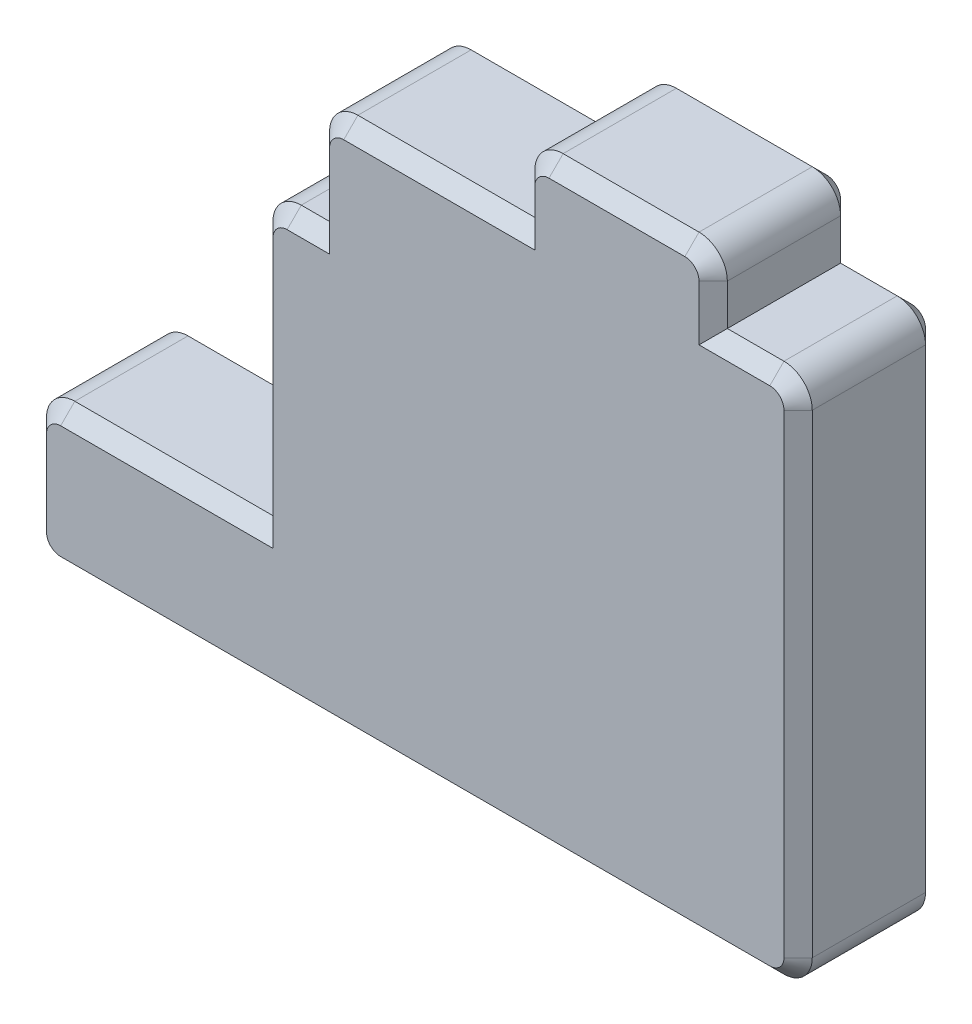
ISO-10303-21;
HEADER;
FILE_DESCRIPTION(('STEP AP214'),'2;1');
FILE_NAME('part.step','',(''),(''),'','','');
FILE_SCHEMA(('AUTOMOTIVE_DESIGN { 1 0 10303 214 1 1 1 1 }'));
ENDSEC;
DATA;
#1=APPLICATION_CONTEXT('core data for automotive mechanical design processes');
#2=APPLICATION_PROTOCOL_DEFINITION('international standard','automotive_design',2000,#1);
#3=PRODUCT_CONTEXT('',#1,'mechanical');
#4=PRODUCT('Part','Part','',(#3));
#5=PRODUCT_RELATED_PRODUCT_CATEGORY('part','',(#4));
#6=PRODUCT_DEFINITION_FORMATION('','',#4);
#7=PRODUCT_DEFINITION_CONTEXT('part definition',#1,'design');
#8=PRODUCT_DEFINITION('design','',#6,#7);
#9=PRODUCT_DEFINITION_SHAPE('','',#8);
#10=(LENGTH_UNIT() NAMED_UNIT(*) SI_UNIT(.MILLI.,.METRE.));
#11=(NAMED_UNIT(*) PLANE_ANGLE_UNIT() SI_UNIT($,.RADIAN.));
#12=(NAMED_UNIT(*) SI_UNIT($,.STERADIAN.) SOLID_ANGLE_UNIT());
#13=UNCERTAINTY_MEASURE_WITH_UNIT(LENGTH_MEASURE(1.E-05),#10,'distance_accuracy_value','');
#14=(GEOMETRIC_REPRESENTATION_CONTEXT(3) GLOBAL_UNCERTAINTY_ASSIGNED_CONTEXT((#13)) GLOBAL_UNIT_ASSIGNED_CONTEXT((#10,
#11,#12)) REPRESENTATION_CONTEXT('',''));
#15=CARTESIAN_POINT('',(0.,0.,0.));
#16=DIRECTION('',(0.,0.,1.));
#17=DIRECTION('',(1.,0.,0.));
#18=AXIS2_PLACEMENT_3D('',#15,#16,#17);
#19=CARTESIAN_POINT('',(-72.1810199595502,-21.0305879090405,5.));
#20=DIRECTION('',(1.,0.,0.));
#21=DIRECTION('',(0.,0.,-1.));
#22=AXIS2_PLACEMENT_3D('',#19,#20,#21);
#23=PLANE('',#22);
#24=DIRECTION('',(0.,0.,-1.));
#25=VECTOR('',#24,1.);
#26=CARTESIAN_POINT('',(-72.1810199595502,-20.0305879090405,5.));
#27=LINE('',#26,#25);
#28=CARTESIAN_POINT('',(-72.1810199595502,-20.0305879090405,0.500000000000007));
#29=VERTEX_POINT('',#28);
#30=CARTESIAN_POINT('',(-72.1810199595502,-20.0305879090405,4.5));
#31=VERTEX_POINT('',#30);
#32=EDGE_CURVE('E637',#29,#31,#27,.F.);
#33=ORIENTED_EDGE('',*,*,#32,.T.);
#34=DIRECTION('',(0.,1.,0.));
#35=VECTOR('',#34,1.);
#36=CARTESIAN_POINT('',(-72.1810199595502,-21.0305879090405,4.5));
#37=LINE('',#36,#35);
#38=CARTESIAN_POINT('',(-72.1810199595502,-17.0305879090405,4.5));
#39=VERTEX_POINT('',#38);
#40=EDGE_CURVE('E402',#31,#39,#37,.T.);
#41=ORIENTED_EDGE('',*,*,#40,.T.);
#42=DIRECTION('',(0.,0.,-1.));
#43=VECTOR('',#42,1.);
#44=CARTESIAN_POINT('',(-72.1810199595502,-17.0305879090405,5.));
#45=LINE('',#44,#43);
#46=CARTESIAN_POINT('',(-72.1810199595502,-17.0305879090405,0.500000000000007));
#47=VERTEX_POINT('',#46);
#48=EDGE_CURVE('E633',#39,#47,#45,.T.);
#49=ORIENTED_EDGE('',*,*,#48,.T.);
#50=DIRECTION('',(0.,-1.,0.));
#51=VECTOR('',#50,1.);
#52=CARTESIAN_POINT('',(-72.1810199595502,-20.0305879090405,0.500000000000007));
#53=LINE('',#52,#51);
#54=EDGE_CURVE('E400',#47,#29,#53,.T.);
#55=ORIENTED_EDGE('',*,*,#54,.T.);
#56=EDGE_LOOP('',(#33,#41,#49,#55));
#57=FACE_BOUND('',#56,.T.);
#58=ADVANCED_FACE('F35',(#57),#23,.F.);
#59=CARTESIAN_POINT('',(-45.1310199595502,-21.0305879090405,5.));
#60=DIRECTION('',(0.,1.,0.));
#61=DIRECTION('',(0.,0.,1.));
#62=AXIS2_PLACEMENT_3D('',#59,#60,#61);
#63=PLANE('',#62);
#64=DIRECTION('',(0.,0.,-1.));
#65=VECTOR('',#64,1.);
#66=CARTESIAN_POINT('',(-46.1310199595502,-21.0305879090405,5.));
#67=LINE('',#66,#65);
#68=CARTESIAN_POINT('',(-46.1310199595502,-21.0305879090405,0.500000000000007));
#69=VERTEX_POINT('',#68);
#70=CARTESIAN_POINT('',(-46.1310199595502,-21.0305879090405,4.5));
#71=VERTEX_POINT('',#70);
#72=EDGE_CURVE('E724',#69,#71,#67,.F.);
#73=ORIENTED_EDGE('',*,*,#72,.T.);
#74=DIRECTION('',(-1.,0.,0.));
#75=VECTOR('',#74,1.);
#76=CARTESIAN_POINT('',(-45.1310199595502,-21.0305879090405,4.5));
#77=LINE('',#76,#75);
#78=CARTESIAN_POINT('',(-71.1810199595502,-21.0305879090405,4.5));
#79=VERTEX_POINT('',#78);
#80=EDGE_CURVE('E394',#71,#79,#77,.T.);
#81=ORIENTED_EDGE('',*,*,#80,.T.);
#82=DIRECTION('',(0.,0.,-1.));
#83=VECTOR('',#82,1.);
#84=CARTESIAN_POINT('',(-71.1810199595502,-21.0305879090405,5.));
#85=LINE('',#84,#83);
#86=CARTESIAN_POINT('',(-71.1810199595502,-21.0305879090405,0.500000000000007));
#87=VERTEX_POINT('',#86);
#88=EDGE_CURVE('E727',#79,#87,#85,.T.);
#89=ORIENTED_EDGE('',*,*,#88,.T.);
#90=DIRECTION('',(1.,0.,0.));
#91=VECTOR('',#90,1.);
#92=CARTESIAN_POINT('',(-46.1310199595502,-21.0305879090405,0.500000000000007));
#93=LINE('',#92,#91);
#94=EDGE_CURVE('E392',#87,#69,#93,.T.);
#95=ORIENTED_EDGE('',*,*,#94,.T.);
#96=EDGE_LOOP('',(#73,#81,#89,#95));
#97=FACE_BOUND('',#96,.T.);
#98=ADVANCED_FACE('F723',(#97),#63,.F.);
#99=CARTESIAN_POINT('',(-45.1310199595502,-2.28058790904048,5.));
#100=DIRECTION('',(-1.,0.,0.));
#101=DIRECTION('',(0.,0.,1.));
#102=AXIS2_PLACEMENT_3D('',#99,#100,#101);
#103=PLANE('',#102);
#104=DIRECTION('',(0.,0.,-1.));
#105=VECTOR('',#104,1.);
#106=CARTESIAN_POINT('',(-45.1310199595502,-3.28058790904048,5.));
#107=LINE('',#106,#105);
#108=CARTESIAN_POINT('',(-45.1310199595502,-3.28058790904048,0.500000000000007));
#109=VERTEX_POINT('',#108);
#110=CARTESIAN_POINT('',(-45.1310199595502,-3.28058790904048,4.5));
#111=VERTEX_POINT('',#110);
#112=EDGE_CURVE('E648',#109,#111,#107,.F.);
#113=ORIENTED_EDGE('',*,*,#112,.T.);
#114=DIRECTION('',(0.,-1.,0.));
#115=VECTOR('',#114,1.);
#116=CARTESIAN_POINT('',(-45.1310199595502,-2.28058790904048,4.5));
#117=LINE('',#116,#115);
#118=CARTESIAN_POINT('',(-45.1310199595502,-20.0305879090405,4.5));
#119=VERTEX_POINT('',#118);
#120=EDGE_CURVE('E385',#111,#119,#117,.T.);
#121=ORIENTED_EDGE('',*,*,#120,.T.);
#122=DIRECTION('',(0.,0.,-1.));
#123=VECTOR('',#122,1.);
#124=CARTESIAN_POINT('',(-45.1310199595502,-20.0305879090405,5.));
#125=LINE('',#124,#123);
#126=CARTESIAN_POINT('',(-45.1310199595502,-20.0305879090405,0.500000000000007));
#127=VERTEX_POINT('',#126);
#128=EDGE_CURVE('E651',#119,#127,#125,.T.);
#129=ORIENTED_EDGE('',*,*,#128,.T.);
#130=DIRECTION('',(0.,1.,0.));
#131=VECTOR('',#130,1.);
#132=CARTESIAN_POINT('',(-45.1310199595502,-3.28058790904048,0.500000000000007));
#133=LINE('',#132,#131);
#134=EDGE_CURVE('E383',#127,#109,#133,.T.);
#135=ORIENTED_EDGE('',*,*,#134,.T.);
#136=EDGE_LOOP('',(#113,#121,#129,#135));
#137=FACE_BOUND('',#136,.T.);
#138=ADVANCED_FACE('F863',(#137),#103,.F.);
#139=CARTESIAN_POINT('',(-48.1310199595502,-2.28058790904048,5.));
#140=DIRECTION('',(0.,-1.,0.));
#141=DIRECTION('',(0.,0.,-1.));
#142=AXIS2_PLACEMENT_3D('',#139,#140,#141);
#143=PLANE('',#142);
#144=DIRECTION('',(0.,0.,-1.));
#145=VECTOR('',#144,1.);
#146=CARTESIAN_POINT('',(-48.1310199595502,-2.28058790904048,5.));
#147=LINE('',#146,#145);
#148=CARTESIAN_POINT('',(-48.1310199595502,-2.28058790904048,4.5));
#149=VERTEX_POINT('',#148);
#150=CARTESIAN_POINT('',(-48.1310199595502,-2.28058790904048,0.500000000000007));
#151=VERTEX_POINT('',#150);
#152=EDGE_CURVE('E691',#149,#151,#147,.T.);
#153=ORIENTED_EDGE('',*,*,#152,.F.);
#154=DIRECTION('',(1.,0.,0.));
#155=VECTOR('',#154,1.);
#156=CARTESIAN_POINT('',(-48.1310199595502,-2.28058790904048,4.5));
#157=LINE('',#156,#155);
#158=CARTESIAN_POINT('',(-46.1310199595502,-2.28058790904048,4.5));
#159=VERTEX_POINT('',#158);
#160=EDGE_CURVE('E377',#149,#159,#157,.T.);
#161=ORIENTED_EDGE('',*,*,#160,.T.);
#162=DIRECTION('',(0.,0.,-1.));
#163=VECTOR('',#162,1.);
#164=CARTESIAN_POINT('',(-46.1310199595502,-2.28058790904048,5.));
#165=LINE('',#164,#163);
#166=CARTESIAN_POINT('',(-46.1310199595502,-2.28058790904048,0.500000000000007));
#167=VERTEX_POINT('',#166);
#168=EDGE_CURVE('E654',#159,#167,#165,.T.);
#169=ORIENTED_EDGE('',*,*,#168,.T.);
#170=DIRECTION('',(-1.,0.,0.));
#171=VECTOR('',#170,1.);
#172=CARTESIAN_POINT('',(-48.1310199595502,-2.28058790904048,0.500000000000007));
#173=LINE('',#172,#171);
#174=EDGE_CURVE('E375',#167,#151,#173,.T.);
#175=ORIENTED_EDGE('',*,*,#174,.T.);
#176=EDGE_LOOP('',(#153,#161,#169,#175));
#177=FACE_BOUND('',#176,.T.);
#178=ADVANCED_FACE('F689',(#177),#143,.F.);
#179=CARTESIAN_POINT('',(-48.1310199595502,0.169412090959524,5.));
#180=DIRECTION('',(-1.,0.,0.));
#181=DIRECTION('',(0.,0.,1.));
#182=AXIS2_PLACEMENT_3D('',#179,#180,#181);
#183=PLANE('',#182);
#184=DIRECTION('',(0.,0.,-1.));
#185=VECTOR('',#184,1.);
#186=CARTESIAN_POINT('',(-48.1310199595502,-0.830587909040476,5.));
#187=LINE('',#186,#185);
#188=CARTESIAN_POINT('',(-48.1310199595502,-0.830587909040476,0.500000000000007));
#189=VERTEX_POINT('',#188);
#190=CARTESIAN_POINT('',(-48.1310199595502,-0.830587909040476,4.5));
#191=VERTEX_POINT('',#190);
#192=EDGE_CURVE('E578',#189,#191,#187,.F.);
#193=ORIENTED_EDGE('',*,*,#192,.T.);
#194=DIRECTION('',(0.,-1.,0.));
#195=VECTOR('',#194,1.);
#196=CARTESIAN_POINT('',(-48.1310199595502,0.169412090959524,4.5));
#197=LINE('',#196,#195);
#198=EDGE_CURVE('E373',#191,#149,#197,.T.);
#199=ORIENTED_EDGE('',*,*,#198,.T.);
#200=ORIENTED_EDGE('',*,*,#152,.T.);
#201=DIRECTION('',(0.,1.,0.));
#202=VECTOR('',#201,1.);
#203=CARTESIAN_POINT('',(-48.1310199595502,-0.830587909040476,0.500000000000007));
#204=LINE('',#203,#202);
#205=EDGE_CURVE('E371',#151,#189,#204,.T.);
#206=ORIENTED_EDGE('',*,*,#205,.T.);
#207=EDGE_LOOP('',(#193,#199,#200,#206));
#208=FACE_BOUND('',#207,.T.);
#209=ADVANCED_FACE('F666',(#208),#183,.F.);
#210=CARTESIAN_POINT('',(-54.9310199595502,0.169412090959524,5.));
#211=DIRECTION('',(0.,-1.,0.));
#212=DIRECTION('',(0.,0.,-1.));
#213=AXIS2_PLACEMENT_3D('',#210,#211,#212);
#214=PLANE('',#213);
#215=DIRECTION('',(0.,0.,-1.));
#216=VECTOR('',#215,1.);
#217=CARTESIAN_POINT('',(-53.9310199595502,0.169412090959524,5.));
#218=LINE('',#217,#216);
#219=CARTESIAN_POINT('',(-53.9310199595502,0.169412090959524,0.500000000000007));
#220=VERTEX_POINT('',#219);
#221=CARTESIAN_POINT('',(-53.9310199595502,0.169412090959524,4.5));
#222=VERTEX_POINT('',#221);
#223=EDGE_CURVE('E657',#220,#222,#218,.F.);
#224=ORIENTED_EDGE('',*,*,#223,.T.);
#225=DIRECTION('',(1.,0.,0.));
#226=VECTOR('',#225,1.);
#227=CARTESIAN_POINT('',(-54.9310199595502,0.169412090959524,4.5));
#228=LINE('',#227,#226);
#229=CARTESIAN_POINT('',(-49.1310199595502,0.169412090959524,4.5));
#230=VERTEX_POINT('',#229);
#231=EDGE_CURVE('E365',#222,#230,#228,.T.);
#232=ORIENTED_EDGE('',*,*,#231,.T.);
#233=DIRECTION('',(0.,0.,-1.));
#234=VECTOR('',#233,1.);
#235=CARTESIAN_POINT('',(-49.1310199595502,0.169412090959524,5.));
#236=LINE('',#235,#234);
#237=CARTESIAN_POINT('',(-49.1310199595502,0.169412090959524,0.500000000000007));
#238=VERTEX_POINT('',#237);
#239=EDGE_CURVE('E660',#230,#238,#236,.T.);
#240=ORIENTED_EDGE('',*,*,#239,.T.);
#241=DIRECTION('',(-1.,0.,0.));
#242=VECTOR('',#241,1.);
#243=CARTESIAN_POINT('',(-53.9310199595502,0.169412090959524,0.500000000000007));
#244=LINE('',#243,#242);
#245=EDGE_CURVE('E363',#238,#220,#244,.T.);
#246=ORIENTED_EDGE('',*,*,#245,.T.);
#247=EDGE_LOOP('',(#224,#232,#240,#246));
#248=FACE_BOUND('',#247,.T.);
#249=ADVANCED_FACE('F1399',(#248),#214,.F.);
#250=CARTESIAN_POINT('',(-54.9310199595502,-2.28058790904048,5.));
#251=DIRECTION('',(1.,0.,0.));
#252=DIRECTION('',(0.,0.,-1.));
#253=AXIS2_PLACEMENT_3D('',#250,#251,#252);
#254=PLANE('',#253);
#255=DIRECTION('',(0.,0.,-1.));
#256=VECTOR('',#255,1.);
#257=CARTESIAN_POINT('',(-54.9310199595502,-2.28058790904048,5.));
#258=LINE('',#257,#256);
#259=CARTESIAN_POINT('',(-54.9310199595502,-2.28058790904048,4.5));
#260=VERTEX_POINT('',#259);
#261=CARTESIAN_POINT('',(-54.9310199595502,-2.28058790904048,0.500000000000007));
#262=VERTEX_POINT('',#261);
#263=EDGE_CURVE('E734',#260,#262,#258,.T.);
#264=ORIENTED_EDGE('',*,*,#263,.F.);
#265=DIRECTION('',(0.,1.,0.));
#266=VECTOR('',#265,1.);
#267=CARTESIAN_POINT('',(-54.9310199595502,-2.28058790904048,4.5));
#268=LINE('',#267,#266);
#269=CARTESIAN_POINT('',(-54.9310199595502,-0.830587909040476,4.5));
#270=VERTEX_POINT('',#269);
#271=EDGE_CURVE('E357',#260,#270,#268,.T.);
#272=ORIENTED_EDGE('',*,*,#271,.T.);
#273=DIRECTION('',(0.,0.,-1.));
#274=VECTOR('',#273,1.);
#275=CARTESIAN_POINT('',(-54.9310199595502,-0.830587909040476,5.));
#276=LINE('',#275,#274);
#277=CARTESIAN_POINT('',(-54.9310199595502,-0.830587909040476,0.500000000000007));
#278=VERTEX_POINT('',#277);
#279=EDGE_CURVE('E574',#270,#278,#276,.T.);
#280=ORIENTED_EDGE('',*,*,#279,.T.);
#281=DIRECTION('',(0.,-1.,0.));
#282=VECTOR('',#281,1.);
#283=CARTESIAN_POINT('',(-54.9310199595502,-2.28058790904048,0.500000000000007));
#284=LINE('',#283,#282);
#285=EDGE_CURVE('E355',#278,#262,#284,.T.);
#286=ORIENTED_EDGE('',*,*,#285,.T.);
#287=EDGE_LOOP('',(#264,#272,#280,#286));
#288=FACE_BOUND('',#287,.T.);
#289=ADVANCED_FACE('F835',(#288),#254,.F.);
#290=CARTESIAN_POINT('',(-62.1810199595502,-2.28058790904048,5.));
#291=DIRECTION('',(0.,-1.,0.));
#292=DIRECTION('',(0.,0.,-1.));
#293=AXIS2_PLACEMENT_3D('',#290,#291,#292);
#294=PLANE('',#293);
#295=DIRECTION('',(0.,0.,-1.));
#296=VECTOR('',#295,1.);
#297=CARTESIAN_POINT('',(-61.1810199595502,-2.28058790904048,5.));
#298=LINE('',#297,#296);
#299=CARTESIAN_POINT('',(-61.1810199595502,-2.28058790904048,0.500000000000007));
#300=VERTEX_POINT('',#299);
#301=CARTESIAN_POINT('',(-61.1810199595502,-2.28058790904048,4.5));
#302=VERTEX_POINT('',#301);
#303=EDGE_CURVE('E313',#300,#302,#298,.F.);
#304=ORIENTED_EDGE('',*,*,#303,.T.);
#305=DIRECTION('',(1.,0.,0.));
#306=VECTOR('',#305,1.);
#307=CARTESIAN_POINT('',(-62.1810199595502,-2.28058790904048,4.5));
#308=LINE('',#307,#306);
#309=EDGE_CURVE('E353',#302,#260,#308,.T.);
#310=ORIENTED_EDGE('',*,*,#309,.T.);
#311=ORIENTED_EDGE('',*,*,#263,.T.);
#312=DIRECTION('',(-1.,0.,0.));
#313=VECTOR('',#312,1.);
#314=CARTESIAN_POINT('',(-61.1810199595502,-2.28058790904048,0.500000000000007));
#315=LINE('',#314,#313);
#316=EDGE_CURVE('E351',#262,#300,#315,.T.);
#317=ORIENTED_EDGE('',*,*,#316,.T.);
#318=EDGE_LOOP('',(#304,#310,#311,#317));
#319=FACE_BOUND('',#318,.T.);
#320=ADVANCED_FACE('F833',(#319),#294,.F.);
#321=CARTESIAN_POINT('',(-62.1810199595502,-6.03058790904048,5.));
#322=DIRECTION('',(1.,0.,0.));
#323=DIRECTION('',(0.,0.,-1.));
#324=AXIS2_PLACEMENT_3D('',#321,#322,#323);
#325=PLANE('',#324);
#326=DIRECTION('',(0.,0.,-1.));
#327=VECTOR('',#326,1.);
#328=CARTESIAN_POINT('',(-62.1810199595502,-6.03058790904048,5.));
#329=LINE('',#328,#327);
#330=CARTESIAN_POINT('',(-62.1810199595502,-6.03058790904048,4.5));
#331=VERTEX_POINT('',#330);
#332=CARTESIAN_POINT('',(-62.1810199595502,-6.03058790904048,0.500000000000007));
#333=VERTEX_POINT('',#332);
#334=EDGE_CURVE('E814',#331,#333,#329,.T.);
#335=ORIENTED_EDGE('',*,*,#334,.F.);
#336=DIRECTION('',(0.,1.,0.));
#337=VECTOR('',#336,1.);
#338=CARTESIAN_POINT('',(-62.1810199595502,-6.03058790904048,4.5));
#339=LINE('',#338,#337);
#340=CARTESIAN_POINT('',(-62.1810199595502,-3.28058790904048,4.5));
#341=VERTEX_POINT('',#340);
#342=EDGE_CURVE('E345',#331,#341,#339,.T.);
#343=ORIENTED_EDGE('',*,*,#342,.T.);
#344=DIRECTION('',(0.,0.,-1.));
#345=VECTOR('',#344,1.);
#346=CARTESIAN_POINT('',(-62.1810199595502,-3.28058790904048,5.));
#347=LINE('',#346,#345);
#348=CARTESIAN_POINT('',(-62.1810199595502,-3.28058790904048,0.500000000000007));
#349=VERTEX_POINT('',#348);
#350=EDGE_CURVE('E566',#341,#349,#347,.T.);
#351=ORIENTED_EDGE('',*,*,#350,.T.);
#352=DIRECTION('',(0.,-1.,0.));
#353=VECTOR('',#352,1.);
#354=CARTESIAN_POINT('',(-62.1810199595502,-6.03058790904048,0.500000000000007));
#355=LINE('',#354,#353);
#356=EDGE_CURVE('E343',#349,#333,#355,.T.);
#357=ORIENTED_EDGE('',*,*,#356,.T.);
#358=EDGE_LOOP('',(#335,#343,#351,#357));
#359=FACE_BOUND('',#358,.T.);
#360=ADVANCED_FACE('F571',(#359),#325,.F.);
#361=CARTESIAN_POINT('',(-64.1810199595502,-6.03058790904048,5.));
#362=DIRECTION('',(0.,-1.,0.));
#363=DIRECTION('',(0.,0.,-1.));
#364=AXIS2_PLACEMENT_3D('',#361,#362,#363);
#365=PLANE('',#364);
#366=DIRECTION('',(0.,0.,-1.));
#367=VECTOR('',#366,1.);
#368=CARTESIAN_POINT('',(-63.1810199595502,-6.03058790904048,5.));
#369=LINE('',#368,#367);
#370=CARTESIAN_POINT('',(-63.1810199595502,-6.03058790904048,0.500000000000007));
#371=VERTEX_POINT('',#370);
#372=CARTESIAN_POINT('',(-63.1810199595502,-6.03058790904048,4.5));
#373=VERTEX_POINT('',#372);
#374=EDGE_CURVE('E640',#371,#373,#369,.F.);
#375=ORIENTED_EDGE('',*,*,#374,.T.);
#376=DIRECTION('',(1.,0.,0.));
#377=VECTOR('',#376,1.);
#378=CARTESIAN_POINT('',(-64.1810199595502,-6.03058790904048,4.5));
#379=LINE('',#378,#377);
#380=EDGE_CURVE('E341',#373,#331,#379,.T.);
#381=ORIENTED_EDGE('',*,*,#380,.T.);
#382=ORIENTED_EDGE('',*,*,#334,.T.);
#383=DIRECTION('',(-1.,0.,0.));
#384=VECTOR('',#383,1.);
#385=CARTESIAN_POINT('',(-63.1810199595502,-6.03058790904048,0.500000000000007));
#386=LINE('',#385,#384);
#387=EDGE_CURVE('E339',#333,#371,#386,.T.);
#388=ORIENTED_EDGE('',*,*,#387,.T.);
#389=EDGE_LOOP('',(#375,#381,#382,#388));
#390=FACE_BOUND('',#389,.T.);
#391=ADVANCED_FACE('F812',(#390),#365,.F.);
#392=CARTESIAN_POINT('',(-64.1810199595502,-16.0305879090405,5.));
#393=DIRECTION('',(1.,0.,0.));
#394=DIRECTION('',(0.,0.,-1.));
#395=AXIS2_PLACEMENT_3D('',#392,#393,#394);
#396=PLANE('',#395);
#397=DIRECTION('',(0.,0.,-1.));
#398=VECTOR('',#397,1.);
#399=CARTESIAN_POINT('',(-64.1810199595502,-16.0305879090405,5.));
#400=LINE('',#399,#398);
#401=CARTESIAN_POINT('',(-64.1810199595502,-16.0305879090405,4.5));
#402=VERTEX_POINT('',#401);
#403=CARTESIAN_POINT('',(-64.1810199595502,-16.0305879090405,0.500000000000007));
#404=VERTEX_POINT('',#403);
#405=EDGE_CURVE('E493',#402,#404,#400,.T.);
#406=ORIENTED_EDGE('',*,*,#405,.F.);
#407=DIRECTION('',(0.,1.,0.));
#408=VECTOR('',#407,1.);
#409=CARTESIAN_POINT('',(-64.1810199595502,-16.0305879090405,4.5));
#410=LINE('',#409,#408);
#411=CARTESIAN_POINT('',(-64.1810199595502,-7.03058790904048,4.5));
#412=VERTEX_POINT('',#411);
#413=EDGE_CURVE('E333',#402,#412,#410,.T.);
#414=ORIENTED_EDGE('',*,*,#413,.T.);
#415=DIRECTION('',(0.,0.,-1.));
#416=VECTOR('',#415,1.);
#417=CARTESIAN_POINT('',(-64.1810199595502,-7.03058790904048,5.));
#418=LINE('',#417,#416);
#419=CARTESIAN_POINT('',(-64.1810199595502,-7.03058790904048,0.500000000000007));
#420=VERTEX_POINT('',#419);
#421=EDGE_CURVE('E636',#412,#420,#418,.T.);
#422=ORIENTED_EDGE('',*,*,#421,.T.);
#423=DIRECTION('',(0.,-1.,0.));
#424=VECTOR('',#423,1.);
#425=CARTESIAN_POINT('',(-64.1810199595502,-16.0305879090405,0.500000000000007));
#426=LINE('',#425,#424);
#427=EDGE_CURVE('E331',#420,#404,#426,.T.);
#428=ORIENTED_EDGE('',*,*,#427,.T.);
#429=EDGE_LOOP('',(#406,#414,#422,#428));
#430=FACE_BOUND('',#429,.T.);
#431=ADVANCED_FACE('F826',(#430),#396,.F.);
#432=CARTESIAN_POINT('',(-72.1810199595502,-16.0305879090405,5.));
#433=DIRECTION('',(0.,-1.,0.));
#434=DIRECTION('',(0.,0.,-1.));
#435=AXIS2_PLACEMENT_3D('',#432,#433,#434);
#436=PLANE('',#435);
#437=DIRECTION('',(0.,0.,-1.));
#438=VECTOR('',#437,1.);
#439=CARTESIAN_POINT('',(-71.1810199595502,-16.0305879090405,5.));
#440=LINE('',#439,#438);
#441=CARTESIAN_POINT('',(-71.1810199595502,-16.0305879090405,0.500000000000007));
#442=VERTEX_POINT('',#441);
#443=CARTESIAN_POINT('',(-71.1810199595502,-16.0305879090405,4.5));
#444=VERTEX_POINT('',#443);
#445=EDGE_CURVE('E630',#442,#444,#440,.F.);
#446=ORIENTED_EDGE('',*,*,#445,.T.);
#447=DIRECTION('',(1.,0.,0.));
#448=VECTOR('',#447,1.);
#449=CARTESIAN_POINT('',(-72.1810199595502,-16.0305879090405,4.5));
#450=LINE('',#449,#448);
#451=EDGE_CURVE('E329',#444,#402,#450,.T.);
#452=ORIENTED_EDGE('',*,*,#451,.T.);
#453=ORIENTED_EDGE('',*,*,#405,.T.);
#454=DIRECTION('',(-1.,0.,0.));
#455=VECTOR('',#454,1.);
#456=CARTESIAN_POINT('',(-71.1810199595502,-16.0305879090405,0.500000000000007));
#457=LINE('',#456,#455);
#458=EDGE_CURVE('E327',#404,#442,#457,.T.);
#459=ORIENTED_EDGE('',*,*,#458,.T.);
#460=EDGE_LOOP('',(#446,#452,#453,#459));
#461=FACE_BOUND('',#460,.T.);
#462=ADVANCED_FACE('F634',(#461),#436,.F.);
#463=CARTESIAN_POINT('',(0.,0.,5.));
#464=DIRECTION('',(0.,0.,-1.));
#465=DIRECTION('',(-1.,0.,0.));
#466=AXIS2_PLACEMENT_3D('',#463,#464,#465);
#467=PLANE('',#466);
#468=DIRECTION('',(-1.,0.,0.));
#469=VECTOR('',#468,1.);
#470=CARTESIAN_POINT('',(0.,-16.5305879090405,5.));
#471=LINE('',#470,#469);
#472=CARTESIAN_POINT('',(-63.6810199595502,-16.5305879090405,5.));
#473=VERTEX_POINT('',#472);
#474=CARTESIAN_POINT('',(-71.1810199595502,-16.5305879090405,5.));
#475=VERTEX_POINT('',#474);
#476=EDGE_CURVE('E317',#473,#475,#471,.T.);
#477=ORIENTED_EDGE('',*,*,#476,.T.);
#478=CARTESIAN_POINT('',(-71.1810199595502,-17.0305879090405,5.));
#479=DIRECTION('',(0.,0.,-1.));
#480=DIRECTION('',(-1.,0.,0.));
#481=AXIS2_PLACEMENT_3D('',#478,#479,#480);
#482=CIRCLE('',#481,0.5);
#483=CARTESIAN_POINT('',(-71.6810199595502,-17.0305879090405,5.));
#484=VERTEX_POINT('',#483);
#485=EDGE_CURVE('E298',#475,#484,#482,.F.);
#486=ORIENTED_EDGE('',*,*,#485,.T.);
#487=DIRECTION('',(0.,-1.,0.));
#488=VECTOR('',#487,1.);
#489=CARTESIAN_POINT('',(-71.6810199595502,0.,5.));
#490=LINE('',#489,#488);
#491=CARTESIAN_POINT('',(-71.6810199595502,-20.0305879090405,5.));
#492=VERTEX_POINT('',#491);
#493=EDGE_CURVE('E306',#484,#492,#490,.T.);
#494=ORIENTED_EDGE('',*,*,#493,.T.);
#495=CARTESIAN_POINT('',(-71.1810199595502,-20.0305879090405,5.));
#496=DIRECTION('',(0.,0.,-1.));
#497=DIRECTION('',(-1.,0.,0.));
#498=AXIS2_PLACEMENT_3D('',#495,#496,#497);
#499=CIRCLE('',#498,0.5);
#500=CARTESIAN_POINT('',(-71.1810199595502,-20.5305879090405,5.));
#501=VERTEX_POINT('',#500);
#502=EDGE_CURVE('E312',#492,#501,#499,.F.);
#503=ORIENTED_EDGE('',*,*,#502,.T.);
#504=DIRECTION('',(1.,0.,0.));
#505=VECTOR('',#504,1.);
#506=CARTESIAN_POINT('',(0.,-20.5305879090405,5.));
#507=LINE('',#506,#505);
#508=CARTESIAN_POINT('',(-46.1310199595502,-20.5305879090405,5.));
#509=VERTEX_POINT('',#508);
#510=EDGE_CURVE('E583',#501,#509,#507,.T.);
#511=ORIENTED_EDGE('',*,*,#510,.T.);
#512=CARTESIAN_POINT('',(-46.1310199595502,-20.0305879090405,5.));
#513=DIRECTION('',(0.,0.,-1.));
#514=DIRECTION('',(-1.,0.,0.));
#515=AXIS2_PLACEMENT_3D('',#512,#513,#514);
#516=CIRCLE('',#515,0.5);
#517=CARTESIAN_POINT('',(-45.6310199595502,-20.0305879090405,5.));
#518=VERTEX_POINT('',#517);
#519=EDGE_CURVE('E585',#509,#518,#516,.F.);
#520=ORIENTED_EDGE('',*,*,#519,.T.);
#521=DIRECTION('',(0.,1.,0.));
#522=VECTOR('',#521,1.);
#523=CARTESIAN_POINT('',(-45.6310199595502,0.,5.));
#524=LINE('',#523,#522);
#525=CARTESIAN_POINT('',(-45.6310199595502,-3.28058790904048,5.));
#526=VERTEX_POINT('',#525);
#527=EDGE_CURVE('E587',#518,#526,#524,.T.);
#528=ORIENTED_EDGE('',*,*,#527,.T.);
#529=CARTESIAN_POINT('',(-46.1310199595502,-3.28058790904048,5.));
#530=DIRECTION('',(0.,0.,-1.));
#531=DIRECTION('',(-1.,0.,0.));
#532=AXIS2_PLACEMENT_3D('',#529,#530,#531);
#533=CIRCLE('',#532,0.5);
#534=CARTESIAN_POINT('',(-46.1310199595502,-2.78058790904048,5.));
#535=VERTEX_POINT('',#534);
#536=EDGE_CURVE('E589',#526,#535,#533,.F.);
#537=ORIENTED_EDGE('',*,*,#536,.T.);
#538=DIRECTION('',(-1.,0.,0.));
#539=VECTOR('',#538,1.);
#540=CARTESIAN_POINT('',(0.,-2.78058790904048,5.));
#541=LINE('',#540,#539);
#542=CARTESIAN_POINT('',(-48.6310199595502,-2.78058790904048,5.));
#543=VERTEX_POINT('',#542);
#544=EDGE_CURVE('E591',#535,#543,#541,.T.);
#545=ORIENTED_EDGE('',*,*,#544,.T.);
#546=DIRECTION('',(0.,1.,0.));
#547=VECTOR('',#546,1.);
#548=CARTESIAN_POINT('',(-48.6310199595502,0.,5.));
#549=LINE('',#548,#547);
#550=CARTESIAN_POINT('',(-48.6310199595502,-0.830587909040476,5.));
#551=VERTEX_POINT('',#550);
#552=EDGE_CURVE('E593',#543,#551,#549,.T.);
#553=ORIENTED_EDGE('',*,*,#552,.T.);
#554=CARTESIAN_POINT('',(-49.1310199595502,-0.830587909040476,5.));
#555=DIRECTION('',(0.,0.,-1.));
#556=DIRECTION('',(-1.,0.,0.));
#557=AXIS2_PLACEMENT_3D('',#554,#555,#556);
#558=CIRCLE('',#557,0.5);
#559=CARTESIAN_POINT('',(-49.1310199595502,-0.330587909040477,5.));
#560=VERTEX_POINT('',#559);
#561=EDGE_CURVE('E595',#551,#560,#558,.F.);
#562=ORIENTED_EDGE('',*,*,#561,.T.);
#563=DIRECTION('',(-1.,0.,0.));
#564=VECTOR('',#563,1.);
#565=CARTESIAN_POINT('',(0.,-0.330587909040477,5.));
#566=LINE('',#565,#564);
#567=CARTESIAN_POINT('',(-53.9310199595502,-0.330587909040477,5.));
#568=VERTEX_POINT('',#567);
#569=EDGE_CURVE('E597',#560,#568,#566,.T.);
#570=ORIENTED_EDGE('',*,*,#569,.T.);
#571=CARTESIAN_POINT('',(-53.9310199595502,-0.830587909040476,5.));
#572=DIRECTION('',(0.,0.,-1.));
#573=DIRECTION('',(-1.,0.,0.));
#574=AXIS2_PLACEMENT_3D('',#571,#572,#573);
#575=CIRCLE('',#574,0.5);
#576=CARTESIAN_POINT('',(-54.4310199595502,-0.830587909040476,5.));
#577=VERTEX_POINT('',#576);
#578=EDGE_CURVE('E599',#568,#577,#575,.F.);
#579=ORIENTED_EDGE('',*,*,#578,.T.);
#580=DIRECTION('',(0.,-1.,0.));
#581=VECTOR('',#580,1.);
#582=CARTESIAN_POINT('',(-54.4310199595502,0.,5.));
#583=LINE('',#582,#581);
#584=CARTESIAN_POINT('',(-54.4310199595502,-2.78058790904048,5.));
#585=VERTEX_POINT('',#584);
#586=EDGE_CURVE('E601',#577,#585,#583,.T.);
#587=ORIENTED_EDGE('',*,*,#586,.T.);
#588=DIRECTION('',(-1.,0.,0.));
#589=VECTOR('',#588,1.);
#590=CARTESIAN_POINT('',(0.,-2.78058790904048,5.));
#591=LINE('',#590,#589);
#592=CARTESIAN_POINT('',(-61.1810199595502,-2.78058790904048,5.));
#593=VERTEX_POINT('',#592);
#594=EDGE_CURVE('E603',#585,#593,#591,.T.);
#595=ORIENTED_EDGE('',*,*,#594,.T.);
#596=CARTESIAN_POINT('',(-61.1810199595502,-3.28058790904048,5.));
#597=DIRECTION('',(0.,0.,-1.));
#598=DIRECTION('',(-1.,0.,0.));
#599=AXIS2_PLACEMENT_3D('',#596,#597,#598);
#600=CIRCLE('',#599,0.5);
#601=CARTESIAN_POINT('',(-61.6810199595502,-3.28058790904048,5.));
#602=VERTEX_POINT('',#601);
#603=EDGE_CURVE('E605',#593,#602,#600,.F.);
#604=ORIENTED_EDGE('',*,*,#603,.T.);
#605=DIRECTION('',(0.,-1.,0.));
#606=VECTOR('',#605,1.);
#607=CARTESIAN_POINT('',(-61.6810199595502,0.,5.));
#608=LINE('',#607,#606);
#609=CARTESIAN_POINT('',(-61.6810199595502,-6.53058790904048,5.));
#610=VERTEX_POINT('',#609);
#611=EDGE_CURVE('E607',#602,#610,#608,.T.);
#612=ORIENTED_EDGE('',*,*,#611,.T.);
#613=DIRECTION('',(-1.,0.,0.));
#614=VECTOR('',#613,1.);
#615=CARTESIAN_POINT('',(0.,-6.53058790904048,5.));
#616=LINE('',#615,#614);
#617=CARTESIAN_POINT('',(-63.1810199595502,-6.53058790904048,5.));
#618=VERTEX_POINT('',#617);
#619=EDGE_CURVE('E609',#610,#618,#616,.T.);
#620=ORIENTED_EDGE('',*,*,#619,.T.);
#621=CARTESIAN_POINT('',(-63.1810199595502,-7.03058790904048,5.));
#622=DIRECTION('',(0.,0.,-1.));
#623=DIRECTION('',(-1.,0.,0.));
#624=AXIS2_PLACEMENT_3D('',#621,#622,#623);
#625=CIRCLE('',#624,0.5);
#626=CARTESIAN_POINT('',(-63.6810199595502,-7.03058790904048,5.));
#627=VERTEX_POINT('',#626);
#628=EDGE_CURVE('E611',#618,#627,#625,.F.);
#629=ORIENTED_EDGE('',*,*,#628,.T.);
#630=DIRECTION('',(0.,-1.,0.));
#631=VECTOR('',#630,1.);
#632=CARTESIAN_POINT('',(-63.6810199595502,0.,5.));
#633=LINE('',#632,#631);
#634=EDGE_CURVE('E322',#627,#473,#633,.T.);
#635=ORIENTED_EDGE('',*,*,#634,.T.);
#636=EDGE_LOOP('',(#477,#486,#494,#503,#511,#520,#528,#537,#545,#553,#562,#570,#579,#587,#595,
#604,#612,#620,#629,#635));
#637=FACE_BOUND('',#636,.T.);
#638=ADVANCED_FACE('F315',(#637),#467,.F.);
#639=CARTESIAN_POINT('',(0.,0.,0.));
#640=DIRECTION('',(0.,0.,-1.));
#641=DIRECTION('',(-1.,0.,0.));
#642=AXIS2_PLACEMENT_3D('',#639,#640,#641);
#643=PLANE('',#642);
#644=DIRECTION('',(0.,-1.,0.));
#645=VECTOR('',#644,1.);
#646=CARTESIAN_POINT('',(-45.6310199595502,-20.0305879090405,0.));
#647=LINE('',#646,#645);
#648=CARTESIAN_POINT('',(-45.6310199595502,-3.28058790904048,0.));
#649=VERTEX_POINT('',#648);
#650=CARTESIAN_POINT('',(-45.6310199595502,-20.0305879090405,0.));
#651=VERTEX_POINT('',#650);
#652=EDGE_CURVE('E45',#649,#651,#647,.T.);
#653=ORIENTED_EDGE('',*,*,#652,.T.);
#654=CARTESIAN_POINT('',(-46.1310199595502,-20.0305879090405,0.));
#655=DIRECTION('',(0.,0.,-1.));
#656=DIRECTION('',(-1.,0.,0.));
#657=AXIS2_PLACEMENT_3D('',#654,#655,#656);
#658=CIRCLE('',#657,0.499999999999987);
#659=CARTESIAN_POINT('',(-46.1310199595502,-20.5305879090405,0.));
#660=VERTEX_POINT('',#659);
#661=EDGE_CURVE('E11',#651,#660,#658,.T.);
#662=ORIENTED_EDGE('',*,*,#661,.T.);
#663=DIRECTION('',(-1.,0.,0.));
#664=VECTOR('',#663,1.);
#665=CARTESIAN_POINT('',(-71.1810199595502,-20.5305879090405,0.));
#666=LINE('',#665,#664);
#667=CARTESIAN_POINT('',(-71.1810199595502,-20.5305879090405,0.));
#668=VERTEX_POINT('',#667);
#669=EDGE_CURVE('E404',#660,#668,#666,.T.);
#670=ORIENTED_EDGE('',*,*,#669,.T.);
#671=CARTESIAN_POINT('',(-71.1810199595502,-20.0305879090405,0.));
#672=DIRECTION('',(0.,0.,-1.));
#673=DIRECTION('',(-1.,0.,0.));
#674=AXIS2_PLACEMENT_3D('',#671,#672,#673);
#675=CIRCLE('',#674,0.499999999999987);
#676=CARTESIAN_POINT('',(-71.6810199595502,-20.0305879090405,0.));
#677=VERTEX_POINT('',#676);
#678=EDGE_CURVE('E406',#668,#677,#675,.T.);
#679=ORIENTED_EDGE('',*,*,#678,.T.);
#680=DIRECTION('',(0.,1.,0.));
#681=VECTOR('',#680,1.);
#682=CARTESIAN_POINT('',(-71.6810199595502,-17.0305879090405,0.));
#683=LINE('',#682,#681);
#684=CARTESIAN_POINT('',(-71.6810199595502,-17.0305879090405,0.));
#685=VERTEX_POINT('',#684);
#686=EDGE_CURVE('E408',#677,#685,#683,.T.);
#687=ORIENTED_EDGE('',*,*,#686,.T.);
#688=CARTESIAN_POINT('',(-71.1810199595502,-17.0305879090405,0.));
#689=DIRECTION('',(0.,0.,-1.));
#690=DIRECTION('',(-1.,0.,0.));
#691=AXIS2_PLACEMENT_3D('',#688,#689,#690);
#692=CIRCLE('',#691,0.499999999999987);
#693=CARTESIAN_POINT('',(-71.1810199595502,-16.5305879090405,0.));
#694=VERTEX_POINT('',#693);
#695=EDGE_CURVE('E410',#685,#694,#692,.T.);
#696=ORIENTED_EDGE('',*,*,#695,.T.);
#697=DIRECTION('',(1.,0.,0.));
#698=VECTOR('',#697,1.);
#699=CARTESIAN_POINT('',(-64.1810199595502,-16.5305879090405,0.));
#700=LINE('',#699,#698);
#701=CARTESIAN_POINT('',(-63.6810199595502,-16.5305879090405,0.));
#702=VERTEX_POINT('',#701);
#703=EDGE_CURVE('E412',#694,#702,#700,.T.);
#704=ORIENTED_EDGE('',*,*,#703,.T.);
#705=DIRECTION('',(0.,1.,0.));
#706=VECTOR('',#705,1.);
#707=CARTESIAN_POINT('',(-63.6810199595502,-7.03058790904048,0.));
#708=LINE('',#707,#706);
#709=CARTESIAN_POINT('',(-63.6810199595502,-7.03058790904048,0.));
#710=VERTEX_POINT('',#709);
#711=EDGE_CURVE('E414',#702,#710,#708,.T.);
#712=ORIENTED_EDGE('',*,*,#711,.T.);
#713=CARTESIAN_POINT('',(-63.1810199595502,-7.03058790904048,0.));
#714=DIRECTION('',(0.,0.,-1.));
#715=DIRECTION('',(-1.,0.,0.));
#716=AXIS2_PLACEMENT_3D('',#713,#714,#715);
#717=CIRCLE('',#716,0.499999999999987);
#718=CARTESIAN_POINT('',(-63.1810199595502,-6.53058790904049,0.));
#719=VERTEX_POINT('',#718);
#720=EDGE_CURVE('E416',#710,#719,#717,.T.);
#721=ORIENTED_EDGE('',*,*,#720,.T.);
#722=DIRECTION('',(1.,0.,0.));
#723=VECTOR('',#722,1.);
#724=CARTESIAN_POINT('',(-62.1810199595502,-6.53058790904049,0.));
#725=LINE('',#724,#723);
#726=CARTESIAN_POINT('',(-61.6810199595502,-6.53058790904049,0.));
#727=VERTEX_POINT('',#726);
#728=EDGE_CURVE('E418',#719,#727,#725,.T.);
#729=ORIENTED_EDGE('',*,*,#728,.T.);
#730=DIRECTION('',(0.,1.,0.));
#731=VECTOR('',#730,1.);
#732=CARTESIAN_POINT('',(-61.6810199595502,-3.28058790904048,0.));
#733=LINE('',#732,#731);
#734=CARTESIAN_POINT('',(-61.6810199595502,-3.28058790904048,0.));
#735=VERTEX_POINT('',#734);
#736=EDGE_CURVE('E420',#727,#735,#733,.T.);
#737=ORIENTED_EDGE('',*,*,#736,.T.);
#738=CARTESIAN_POINT('',(-61.1810199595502,-3.28058790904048,0.));
#739=DIRECTION('',(0.,0.,-1.));
#740=DIRECTION('',(-1.,0.,0.));
#741=AXIS2_PLACEMENT_3D('',#738,#739,#740);
#742=CIRCLE('',#741,0.499999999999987);
#743=CARTESIAN_POINT('',(-61.1810199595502,-2.78058790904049,0.));
#744=VERTEX_POINT('',#743);
#745=EDGE_CURVE('E422',#735,#744,#742,.T.);
#746=ORIENTED_EDGE('',*,*,#745,.T.);
#747=DIRECTION('',(1.,0.,0.));
#748=VECTOR('',#747,1.);
#749=CARTESIAN_POINT('',(-54.9310199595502,-2.78058790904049,0.));
#750=LINE('',#749,#748);
#751=CARTESIAN_POINT('',(-54.4310199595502,-2.78058790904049,0.));
#752=VERTEX_POINT('',#751);
#753=EDGE_CURVE('E424',#744,#752,#750,.T.);
#754=ORIENTED_EDGE('',*,*,#753,.T.);
#755=DIRECTION('',(0.,1.,0.));
#756=VECTOR('',#755,1.);
#757=CARTESIAN_POINT('',(-54.4310199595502,-0.830587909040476,0.));
#758=LINE('',#757,#756);
#759=CARTESIAN_POINT('',(-54.4310199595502,-0.830587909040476,0.));
#760=VERTEX_POINT('',#759);
#761=EDGE_CURVE('E426',#752,#760,#758,.T.);
#762=ORIENTED_EDGE('',*,*,#761,.T.);
#763=CARTESIAN_POINT('',(-53.9310199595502,-0.830587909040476,0.));
#764=DIRECTION('',(0.,0.,-1.));
#765=DIRECTION('',(-1.,0.,0.));
#766=AXIS2_PLACEMENT_3D('',#763,#764,#765);
#767=CIRCLE('',#766,0.499999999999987);
#768=CARTESIAN_POINT('',(-53.9310199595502,-0.33058790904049,0.));
#769=VERTEX_POINT('',#768);
#770=EDGE_CURVE('E428',#760,#769,#767,.T.);
#771=ORIENTED_EDGE('',*,*,#770,.T.);
#772=DIRECTION('',(1.,0.,0.));
#773=VECTOR('',#772,1.);
#774=CARTESIAN_POINT('',(-49.1310199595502,-0.330587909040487,0.));
#775=LINE('',#774,#773);
#776=CARTESIAN_POINT('',(-49.1310199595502,-0.330587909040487,0.));
#777=VERTEX_POINT('',#776);
#778=EDGE_CURVE('E430',#769,#777,#775,.T.);
#779=ORIENTED_EDGE('',*,*,#778,.T.);
#780=CARTESIAN_POINT('',(-49.1310199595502,-0.830587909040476,0.));
#781=DIRECTION('',(0.,0.,-1.));
#782=DIRECTION('',(-1.,0.,0.));
#783=AXIS2_PLACEMENT_3D('',#780,#781,#782);
#784=CIRCLE('',#783,0.499999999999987);
#785=CARTESIAN_POINT('',(-48.6310199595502,-0.830587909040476,0.));
#786=VERTEX_POINT('',#785);
#787=EDGE_CURVE('E432',#777,#786,#784,.T.);
#788=ORIENTED_EDGE('',*,*,#787,.T.);
#789=DIRECTION('',(0.,-1.,0.));
#790=VECTOR('',#789,1.);
#791=CARTESIAN_POINT('',(-48.6310199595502,-2.28058790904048,0.));
#792=LINE('',#791,#790);
#793=CARTESIAN_POINT('',(-48.6310199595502,-2.78058790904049,0.));
#794=VERTEX_POINT('',#793);
#795=EDGE_CURVE('E434',#786,#794,#792,.T.);
#796=ORIENTED_EDGE('',*,*,#795,.T.);
#797=DIRECTION('',(1.,0.,0.));
#798=VECTOR('',#797,1.);
#799=CARTESIAN_POINT('',(-46.1310199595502,-2.78058790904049,0.));
#800=LINE('',#799,#798);
#801=CARTESIAN_POINT('',(-46.1310199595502,-2.78058790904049,0.));
#802=VERTEX_POINT('',#801);
#803=EDGE_CURVE('E436',#794,#802,#800,.T.);
#804=ORIENTED_EDGE('',*,*,#803,.T.);
#805=CARTESIAN_POINT('',(-46.1310199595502,-3.28058790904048,0.));
#806=DIRECTION('',(0.,0.,-1.));
#807=DIRECTION('',(-1.,0.,0.));
#808=AXIS2_PLACEMENT_3D('',#805,#806,#807);
#809=CIRCLE('',#808,0.499999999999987);
#810=EDGE_CURVE('E56',#802,#649,#809,.T.);
#811=ORIENTED_EDGE('',*,*,#810,.T.);
#812=EDGE_LOOP('',(#653,#662,#670,#679,#687,#696,#704,#712,#721,#729,#737,#746,#754,#762,#771,
#779,#788,#796,#804,#811));
#813=FACE_BOUND('',#812,.T.);
#814=ADVANCED_FACE('F708',(#813),#643,.T.);
#815=CARTESIAN_POINT('',(-71.1810199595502,-20.0305879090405,5.));
#816=DIRECTION('',(0.,0.,-1.));
#817=DIRECTION('',(-1.,0.,0.));
#818=AXIS2_PLACEMENT_3D('',#815,#816,#817);
#819=CYLINDRICAL_SURFACE('',#818,1.);
#820=ORIENTED_EDGE('',*,*,#88,.F.);
#821=CARTESIAN_POINT('',(-71.1810199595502,-20.0305879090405,4.5));
#822=DIRECTION('',(0.,0.,-1.));
#823=DIRECTION('',(-1.,0.,0.));
#824=AXIS2_PLACEMENT_3D('',#821,#822,#823);
#825=CIRCLE('',#824,1.);
#826=EDGE_CURVE('E398',#79,#31,#825,.T.);
#827=ORIENTED_EDGE('',*,*,#826,.T.);
#828=ORIENTED_EDGE('',*,*,#32,.F.);
#829=CARTESIAN_POINT('',(-71.1810199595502,-20.0305879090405,0.500000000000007));
#830=DIRECTION('',(0.,0.,-1.));
#831=DIRECTION('',(-1.,0.,0.));
#832=AXIS2_PLACEMENT_3D('',#829,#830,#831);
#833=CIRCLE('',#832,1.);
#834=EDGE_CURVE('E396',#29,#87,#833,.F.);
#835=ORIENTED_EDGE('',*,*,#834,.T.);
#836=EDGE_LOOP('',(#820,#827,#828,#835));
#837=FACE_BOUND('',#836,.T.);
#838=ADVANCED_FACE('F748',(#837),#819,.T.);
#839=CARTESIAN_POINT('',(-71.1810199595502,-17.0305879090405,5.));
#840=DIRECTION('',(0.,0.,-1.));
#841=DIRECTION('',(-1.,0.,0.));
#842=AXIS2_PLACEMENT_3D('',#839,#840,#841);
#843=CYLINDRICAL_SURFACE('',#842,1.);
#844=ORIENTED_EDGE('',*,*,#48,.F.);
#845=CARTESIAN_POINT('',(-71.1810199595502,-17.0305879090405,4.5));
#846=DIRECTION('',(0.,0.,-1.));
#847=DIRECTION('',(-1.,0.,0.));
#848=AXIS2_PLACEMENT_3D('',#845,#846,#847);
#849=CIRCLE('',#848,1.);
#850=EDGE_CURVE('E300',#39,#444,#849,.T.);
#851=ORIENTED_EDGE('',*,*,#850,.T.);
#852=ORIENTED_EDGE('',*,*,#445,.F.);
#853=CARTESIAN_POINT('',(-71.1810199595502,-17.0305879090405,0.500000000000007));
#854=DIRECTION('',(0.,0.,-1.));
#855=DIRECTION('',(-1.,0.,0.));
#856=AXIS2_PLACEMENT_3D('',#853,#854,#855);
#857=CIRCLE('',#856,1.);
#858=EDGE_CURVE('E319',#442,#47,#857,.F.);
#859=ORIENTED_EDGE('',*,*,#858,.T.);
#860=EDGE_LOOP('',(#844,#851,#852,#859));
#861=FACE_BOUND('',#860,.T.);
#862=ADVANCED_FACE('F629',(#861),#843,.T.);
#863=CARTESIAN_POINT('',(-63.1810199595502,-7.03058790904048,5.));
#864=DIRECTION('',(0.,0.,-1.));
#865=DIRECTION('',(-1.,0.,0.));
#866=AXIS2_PLACEMENT_3D('',#863,#864,#865);
#867=CYLINDRICAL_SURFACE('',#866,1.);
#868=ORIENTED_EDGE('',*,*,#421,.F.);
#869=CARTESIAN_POINT('',(-63.1810199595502,-7.03058790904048,4.5));
#870=DIRECTION('',(0.,0.,-1.));
#871=DIRECTION('',(-1.,0.,0.));
#872=AXIS2_PLACEMENT_3D('',#869,#870,#871);
#873=CIRCLE('',#872,1.);
#874=EDGE_CURVE('E337',#412,#373,#873,.T.);
#875=ORIENTED_EDGE('',*,*,#874,.T.);
#876=ORIENTED_EDGE('',*,*,#374,.F.);
#877=CARTESIAN_POINT('',(-63.1810199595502,-7.03058790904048,0.500000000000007));
#878=DIRECTION('',(0.,0.,-1.));
#879=DIRECTION('',(-1.,0.,0.));
#880=AXIS2_PLACEMENT_3D('',#877,#878,#879);
#881=CIRCLE('',#880,1.);
#882=EDGE_CURVE('E335',#371,#420,#881,.F.);
#883=ORIENTED_EDGE('',*,*,#882,.T.);
#884=EDGE_LOOP('',(#868,#875,#876,#883));
#885=FACE_BOUND('',#884,.T.);
#886=ADVANCED_FACE('F809',(#885),#867,.T.);
#887=CARTESIAN_POINT('',(-46.1310199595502,-20.0305879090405,5.));
#888=DIRECTION('',(0.,0.,-1.));
#889=DIRECTION('',(-1.,0.,0.));
#890=AXIS2_PLACEMENT_3D('',#887,#888,#889);
#891=CYLINDRICAL_SURFACE('',#890,1.);
#892=ORIENTED_EDGE('',*,*,#128,.F.);
#893=CARTESIAN_POINT('',(-46.1310199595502,-20.0305879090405,4.5));
#894=DIRECTION('',(0.,0.,-1.));
#895=DIRECTION('',(-1.,0.,0.));
#896=AXIS2_PLACEMENT_3D('',#893,#894,#895);
#897=CIRCLE('',#896,1.);
#898=EDGE_CURVE('E390',#119,#71,#897,.T.);
#899=ORIENTED_EDGE('',*,*,#898,.T.);
#900=ORIENTED_EDGE('',*,*,#72,.F.);
#901=CARTESIAN_POINT('',(-46.1310199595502,-20.0305879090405,0.500000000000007));
#902=DIRECTION('',(0.,0.,-1.));
#903=DIRECTION('',(-1.,0.,0.));
#904=AXIS2_PLACEMENT_3D('',#901,#902,#903);
#905=CIRCLE('',#904,1.);
#906=EDGE_CURVE('E387',#69,#127,#905,.F.);
#907=ORIENTED_EDGE('',*,*,#906,.T.);
#908=EDGE_LOOP('',(#892,#899,#900,#907));
#909=FACE_BOUND('',#908,.T.);
#910=ADVANCED_FACE('F730',(#909),#891,.T.);
#911=CARTESIAN_POINT('',(-46.1310199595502,-3.28058790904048,5.));
#912=DIRECTION('',(0.,0.,-1.));
#913=DIRECTION('',(-1.,0.,0.));
#914=AXIS2_PLACEMENT_3D('',#911,#912,#913);
#915=CYLINDRICAL_SURFACE('',#914,1.);
#916=ORIENTED_EDGE('',*,*,#168,.F.);
#917=CARTESIAN_POINT('',(-46.1310199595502,-3.28058790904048,4.5));
#918=DIRECTION('',(0.,0.,-1.));
#919=DIRECTION('',(-1.,0.,0.));
#920=AXIS2_PLACEMENT_3D('',#917,#918,#919);
#921=CIRCLE('',#920,1.);
#922=EDGE_CURVE('E381',#159,#111,#921,.T.);
#923=ORIENTED_EDGE('',*,*,#922,.T.);
#924=ORIENTED_EDGE('',*,*,#112,.F.);
#925=CARTESIAN_POINT('',(-46.1310199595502,-3.28058790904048,0.500000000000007));
#926=DIRECTION('',(0.,0.,-1.));
#927=DIRECTION('',(-1.,0.,0.));
#928=AXIS2_PLACEMENT_3D('',#925,#926,#927);
#929=CIRCLE('',#928,1.);
#930=EDGE_CURVE('E379',#109,#167,#929,.F.);
#931=ORIENTED_EDGE('',*,*,#930,.T.);
#932=EDGE_LOOP('',(#916,#923,#924,#931));
#933=FACE_BOUND('',#932,.T.);
#934=ADVANCED_FACE('F693',(#933),#915,.T.);
#935=CARTESIAN_POINT('',(-49.1310199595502,-0.830587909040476,5.));
#936=DIRECTION('',(0.,0.,-1.));
#937=DIRECTION('',(-1.,0.,0.));
#938=AXIS2_PLACEMENT_3D('',#935,#936,#937);
#939=CYLINDRICAL_SURFACE('',#938,1.);
#940=ORIENTED_EDGE('',*,*,#239,.F.);
#941=CARTESIAN_POINT('',(-49.1310199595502,-0.830587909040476,4.5));
#942=DIRECTION('',(0.,0.,-1.));
#943=DIRECTION('',(-1.,0.,0.));
#944=AXIS2_PLACEMENT_3D('',#941,#942,#943);
#945=CIRCLE('',#944,1.);
#946=EDGE_CURVE('E369',#230,#191,#945,.T.);
#947=ORIENTED_EDGE('',*,*,#946,.T.);
#948=ORIENTED_EDGE('',*,*,#192,.F.);
#949=CARTESIAN_POINT('',(-49.1310199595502,-0.830587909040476,0.500000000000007));
#950=DIRECTION('',(0.,0.,-1.));
#951=DIRECTION('',(-1.,0.,0.));
#952=AXIS2_PLACEMENT_3D('',#949,#950,#951);
#953=CIRCLE('',#952,1.);
#954=EDGE_CURVE('E367',#189,#238,#953,.F.);
#955=ORIENTED_EDGE('',*,*,#954,.T.);
#956=EDGE_LOOP('',(#940,#947,#948,#955));
#957=FACE_BOUND('',#956,.T.);
#958=ADVANCED_FACE('F877',(#957),#939,.T.);
#959=CARTESIAN_POINT('',(-53.9310199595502,-0.830587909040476,5.));
#960=DIRECTION('',(0.,0.,-1.));
#961=DIRECTION('',(-1.,0.,0.));
#962=AXIS2_PLACEMENT_3D('',#959,#960,#961);
#963=CYLINDRICAL_SURFACE('',#962,1.);
#964=ORIENTED_EDGE('',*,*,#279,.F.);
#965=CARTESIAN_POINT('',(-53.9310199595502,-0.830587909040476,4.5));
#966=DIRECTION('',(0.,0.,-1.));
#967=DIRECTION('',(-1.,0.,0.));
#968=AXIS2_PLACEMENT_3D('',#965,#966,#967);
#969=CIRCLE('',#968,1.);
#970=EDGE_CURVE('E361',#270,#222,#969,.T.);
#971=ORIENTED_EDGE('',*,*,#970,.T.);
#972=ORIENTED_EDGE('',*,*,#223,.F.);
#973=CARTESIAN_POINT('',(-53.9310199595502,-0.830587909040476,0.500000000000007));
#974=DIRECTION('',(0.,0.,-1.));
#975=DIRECTION('',(-1.,0.,0.));
#976=AXIS2_PLACEMENT_3D('',#973,#974,#975);
#977=CIRCLE('',#976,1.);
#978=EDGE_CURVE('E359',#220,#278,#977,.F.);
#979=ORIENTED_EDGE('',*,*,#978,.T.);
#980=EDGE_LOOP('',(#964,#971,#972,#979));
#981=FACE_BOUND('',#980,.T.);
#982=ADVANCED_FACE('F880',(#981),#963,.T.);
#983=CARTESIAN_POINT('',(-61.1810199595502,-3.28058790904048,5.));
#984=DIRECTION('',(0.,0.,-1.));
#985=DIRECTION('',(-1.,0.,0.));
#986=AXIS2_PLACEMENT_3D('',#983,#984,#985);
#987=CYLINDRICAL_SURFACE('',#986,1.);
#988=ORIENTED_EDGE('',*,*,#350,.F.);
#989=CARTESIAN_POINT('',(-61.1810199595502,-3.28058790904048,4.5));
#990=DIRECTION('',(0.,0.,-1.));
#991=DIRECTION('',(-1.,0.,0.));
#992=AXIS2_PLACEMENT_3D('',#989,#990,#991);
#993=CIRCLE('',#992,1.);
#994=EDGE_CURVE('E349',#341,#302,#993,.T.);
#995=ORIENTED_EDGE('',*,*,#994,.T.);
#996=ORIENTED_EDGE('',*,*,#303,.F.);
#997=CARTESIAN_POINT('',(-61.1810199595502,-3.28058790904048,0.500000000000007));
#998=DIRECTION('',(0.,0.,-1.));
#999=DIRECTION('',(-1.,0.,0.));
#1000=AXIS2_PLACEMENT_3D('',#997,#998,#999);
#1001=CIRCLE('',#1000,1.);
#1002=EDGE_CURVE('E347',#300,#349,#1001,.F.);
#1003=ORIENTED_EDGE('',*,*,#1002,.T.);
#1004=EDGE_LOOP('',(#988,#995,#996,#1003));
#1005=FACE_BOUND('',#1004,.T.);
#1006=ADVANCED_FACE('F565',(#1005),#987,.T.);
#1007=CARTESIAN_POINT('',(0.,-0.330587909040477,5.));
#1008=DIRECTION('',(0.,-0.707106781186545,-0.70710678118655));
#1009=DIRECTION('',(-1.,0.,0.));
#1010=AXIS2_PLACEMENT_3D('',#1007,#1008,#1009);
#1011=PLANE('',#1010);
#1012=DIRECTION('',(0.,-0.70710678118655,0.707106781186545));
#1013=VECTOR('',#1012,1.);
#1014=CARTESIAN_POINT('',(-49.1310199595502,0.169412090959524,4.5));
#1015=LINE('',#1014,#1013);
#1016=EDGE_CURVE('E487',#230,#560,#1015,.T.);
#1017=ORIENTED_EDGE('',*,*,#1016,.F.);
#1018=ORIENTED_EDGE('',*,*,#231,.F.);
#1019=DIRECTION('',(0.,0.70710678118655,-0.707106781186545));
#1020=VECTOR('',#1019,1.);
#1021=CARTESIAN_POINT('',(-53.9310199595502,-0.330587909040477,5.));
#1022=LINE('',#1021,#1020);
#1023=EDGE_CURVE('E490',#568,#222,#1022,.T.);
#1024=ORIENTED_EDGE('',*,*,#1023,.F.);
#1025=ORIENTED_EDGE('',*,*,#569,.F.);
#1026=EDGE_LOOP('',(#1017,#1018,#1024,#1025));
#1027=FACE_BOUND('',#1026,.T.);
#1028=ADVANCED_FACE('F773',(#1027),#1011,.F.);
#1029=CARTESIAN_POINT('',(-53.9310199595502,-0.830587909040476,5.));
#1030=DIRECTION('',(0.,0.,-1.));
#1031=DIRECTION('',(-1.,0.,0.));
#1032=AXIS2_PLACEMENT_3D('',#1029,#1030,#1031);
#1033=CONICAL_SURFACE('',#1032,0.5,0.785398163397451);
#1034=ORIENTED_EDGE('',*,*,#1023,.T.);
#1035=ORIENTED_EDGE('',*,*,#970,.F.);
#1036=DIRECTION('',(-0.70710678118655,0.,-0.707106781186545));
#1037=VECTOR('',#1036,1.);
#1038=CARTESIAN_POINT('',(-54.4310199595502,-0.830587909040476,5.));
#1039=LINE('',#1038,#1037);
#1040=EDGE_CURVE('E484',#577,#270,#1039,.T.);
#1041=ORIENTED_EDGE('',*,*,#1040,.F.);
#1042=ORIENTED_EDGE('',*,*,#578,.F.);
#1043=EDGE_LOOP('',(#1034,#1035,#1041,#1042));
#1044=FACE_BOUND('',#1043,.T.);
#1045=ADVANCED_FACE('F779',(#1044),#1033,.T.);
#1046=CARTESIAN_POINT('',(-49.1310199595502,-0.830587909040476,5.));
#1047=DIRECTION('',(0.,0.,-1.));
#1048=DIRECTION('',(-1.,0.,0.));
#1049=AXIS2_PLACEMENT_3D('',#1046,#1047,#1048);
#1050=CONICAL_SURFACE('',#1049,0.5,0.785398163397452);
#1051=ORIENTED_EDGE('',*,*,#1016,.T.);
#1052=ORIENTED_EDGE('',*,*,#561,.F.);
#1053=DIRECTION('',(-0.70710678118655,0.,0.707106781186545));
#1054=VECTOR('',#1053,1.);
#1055=CARTESIAN_POINT('',(-48.1310199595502,-0.830587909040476,4.5));
#1056=LINE('',#1055,#1054);
#1057=EDGE_CURVE('E481',#191,#551,#1056,.T.);
#1058=ORIENTED_EDGE('',*,*,#1057,.F.);
#1059=ORIENTED_EDGE('',*,*,#946,.F.);
#1060=EDGE_LOOP('',(#1051,#1052,#1058,#1059));
#1061=FACE_BOUND('',#1060,.T.);
#1062=ADVANCED_FACE('F676',(#1061),#1050,.T.);
#1063=CARTESIAN_POINT('',(-54.4310199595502,0.,5.));
#1064=DIRECTION('',(0.707106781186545,0.,-0.70710678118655));
#1065=DIRECTION('',(0.,-1.,0.));
#1066=AXIS2_PLACEMENT_3D('',#1063,#1064,#1065);
#1067=PLANE('',#1066);
#1068=ORIENTED_EDGE('',*,*,#1040,.T.);
#1069=ORIENTED_EDGE('',*,*,#271,.F.);
#1070=DIRECTION('',(0.577350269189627,-0.577350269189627,0.577350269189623));
#1071=VECTOR('',#1070,1.);
#1072=CARTESIAN_POINT('',(-36.2873466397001,-20.9242612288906,23.14367331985));
#1073=LINE('',#1072,#1071);
#1074=EDGE_CURVE('E478',#585,#260,#1073,.F.);
#1075=ORIENTED_EDGE('',*,*,#1074,.F.);
#1076=ORIENTED_EDGE('',*,*,#586,.F.);
#1077=EDGE_LOOP('',(#1068,#1069,#1075,#1076));
#1078=FACE_BOUND('',#1077,.T.);
#1079=ADVANCED_FACE('F786',(#1078),#1067,.F.);
#1080=CARTESIAN_POINT('',(-48.6310199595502,0.,5.));
#1081=DIRECTION('',(-0.707106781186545,0.,-0.70710678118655));
#1082=DIRECTION('',(0.,1.,0.));
#1083=AXIS2_PLACEMENT_3D('',#1080,#1081,#1082);
#1084=PLANE('',#1083);
#1085=ORIENTED_EDGE('',*,*,#1057,.T.);
#1086=ORIENTED_EDGE('',*,*,#552,.F.);
#1087=DIRECTION('',(-0.577350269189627,-0.577350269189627,0.577350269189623));
#1088=VECTOR('',#1087,1.);
#1089=CARTESIAN_POINT('',(-47.7041573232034,-1.85372527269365,4.07313736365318));
#1090=LINE('',#1089,#1088);
#1091=EDGE_CURVE('E475',#149,#543,#1090,.T.);
#1092=ORIENTED_EDGE('',*,*,#1091,.F.);
#1093=ORIENTED_EDGE('',*,*,#198,.F.);
#1094=EDGE_LOOP('',(#1085,#1086,#1092,#1093));
#1095=FACE_BOUND('',#1094,.T.);
#1096=ADVANCED_FACE('F680',(#1095),#1084,.F.);
#1097=CARTESIAN_POINT('',(0.,-2.78058790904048,5.));
#1098=DIRECTION('',(0.,-0.707106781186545,-0.70710678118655));
#1099=DIRECTION('',(-1.,0.,0.));
#1100=AXIS2_PLACEMENT_3D('',#1097,#1098,#1099);
#1101=PLANE('',#1100);
#1102=ORIENTED_EDGE('',*,*,#1074,.T.);
#1103=ORIENTED_EDGE('',*,*,#309,.F.);
#1104=DIRECTION('',(0.,0.70710678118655,-0.707106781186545));
#1105=VECTOR('',#1104,1.);
#1106=CARTESIAN_POINT('',(-61.1810199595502,-2.78058790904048,5.));
#1107=LINE('',#1106,#1105);
#1108=EDGE_CURVE('E472',#593,#302,#1107,.T.);
#1109=ORIENTED_EDGE('',*,*,#1108,.F.);
#1110=ORIENTED_EDGE('',*,*,#594,.F.);
#1111=EDGE_LOOP('',(#1102,#1103,#1109,#1110));
#1112=FACE_BOUND('',#1111,.T.);
#1113=ADVANCED_FACE('F789',(#1112),#1101,.F.);
#1114=CARTESIAN_POINT('',(0.,-2.78058790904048,5.));
#1115=DIRECTION('',(0.,-0.707106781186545,-0.70710678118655));
#1116=DIRECTION('',(-1.,0.,0.));
#1117=AXIS2_PLACEMENT_3D('',#1114,#1115,#1116);
#1118=PLANE('',#1117);
#1119=ORIENTED_EDGE('',*,*,#1091,.T.);
#1120=ORIENTED_EDGE('',*,*,#544,.F.);
#1121=DIRECTION('',(0.,-0.70710678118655,0.707106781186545));
#1122=VECTOR('',#1121,1.);
#1123=CARTESIAN_POINT('',(-46.1310199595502,-2.28058790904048,4.5));
#1124=LINE('',#1123,#1122);
#1125=EDGE_CURVE('E469',#159,#535,#1124,.T.);
#1126=ORIENTED_EDGE('',*,*,#1125,.F.);
#1127=ORIENTED_EDGE('',*,*,#160,.F.);
#1128=EDGE_LOOP('',(#1119,#1120,#1126,#1127));
#1129=FACE_BOUND('',#1128,.T.);
#1130=ADVANCED_FACE('F685',(#1129),#1118,.F.);
#1131=CARTESIAN_POINT('',(-61.1810199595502,-3.28058790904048,5.));
#1132=DIRECTION('',(0.,0.,-1.));
#1133=DIRECTION('',(-1.,0.,0.));
#1134=AXIS2_PLACEMENT_3D('',#1131,#1132,#1133);
#1135=CONICAL_SURFACE('',#1134,0.5,0.785398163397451);
#1136=ORIENTED_EDGE('',*,*,#1108,.T.);
#1137=ORIENTED_EDGE('',*,*,#994,.F.);
#1138=DIRECTION('',(-0.70710678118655,0.,-0.707106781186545));
#1139=VECTOR('',#1138,1.);
#1140=CARTESIAN_POINT('',(-61.6810199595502,-3.28058790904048,5.));
#1141=LINE('',#1140,#1139);
#1142=EDGE_CURVE('E466',#602,#341,#1141,.T.);
#1143=ORIENTED_EDGE('',*,*,#1142,.F.);
#1144=ORIENTED_EDGE('',*,*,#603,.F.);
#1145=EDGE_LOOP('',(#1136,#1137,#1143,#1144));
#1146=FACE_BOUND('',#1145,.T.);
#1147=ADVANCED_FACE('F793',(#1146),#1135,.T.);
#1148=CARTESIAN_POINT('',(-46.1310199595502,-3.28058790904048,5.));
#1149=DIRECTION('',(0.,0.,-1.));
#1150=DIRECTION('',(-1.,0.,0.));
#1151=AXIS2_PLACEMENT_3D('',#1148,#1149,#1150);
#1152=CONICAL_SURFACE('',#1151,0.5,0.785398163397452);
#1153=ORIENTED_EDGE('',*,*,#1125,.T.);
#1154=ORIENTED_EDGE('',*,*,#536,.F.);
#1155=DIRECTION('',(-0.70710678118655,0.,0.707106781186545));
#1156=VECTOR('',#1155,1.);
#1157=CARTESIAN_POINT('',(-45.1310199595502,-3.28058790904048,4.5));
#1158=LINE('',#1157,#1156);
#1159=EDGE_CURVE('E463',#111,#526,#1158,.T.);
#1160=ORIENTED_EDGE('',*,*,#1159,.F.);
#1161=ORIENTED_EDGE('',*,*,#922,.F.);
#1162=EDGE_LOOP('',(#1153,#1154,#1160,#1161));
#1163=FACE_BOUND('',#1162,.T.);
#1164=ADVANCED_FACE('F768',(#1163),#1152,.T.);
#1165=CARTESIAN_POINT('',(-61.6810199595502,0.,5.));
#1166=DIRECTION('',(0.707106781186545,0.,-0.70710678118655));
#1167=DIRECTION('',(0.,-1.,0.));
#1168=AXIS2_PLACEMENT_3D('',#1165,#1166,#1167);
#1169=PLANE('',#1168);
#1170=ORIENTED_EDGE('',*,*,#1142,.T.);
#1171=ORIENTED_EDGE('',*,*,#342,.F.);
#1172=DIRECTION('',(0.577350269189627,-0.577350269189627,0.577350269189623));
#1173=VECTOR('',#1172,1.);
#1174=CARTESIAN_POINT('',(-41.1206799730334,-27.0909278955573,25.5603399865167));
#1175=LINE('',#1174,#1173);
#1176=EDGE_CURVE('E460',#610,#331,#1175,.F.);
#1177=ORIENTED_EDGE('',*,*,#1176,.F.);
#1178=ORIENTED_EDGE('',*,*,#611,.F.);
#1179=EDGE_LOOP('',(#1170,#1171,#1177,#1178));
#1180=FACE_BOUND('',#1179,.T.);
#1181=ADVANCED_FACE('F799',(#1180),#1169,.F.);
#1182=CARTESIAN_POINT('',(-45.6310199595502,0.,5.));
#1183=DIRECTION('',(-0.707106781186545,0.,-0.70710678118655));
#1184=DIRECTION('',(0.,1.,0.));
#1185=AXIS2_PLACEMENT_3D('',#1182,#1183,#1184);
#1186=PLANE('',#1185);
#1187=ORIENTED_EDGE('',*,*,#1159,.T.);
#1188=ORIENTED_EDGE('',*,*,#527,.F.);
#1189=DIRECTION('',(-0.70710678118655,0.,0.707106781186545));
#1190=VECTOR('',#1189,1.);
#1191=CARTESIAN_POINT('',(-45.1310199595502,-20.0305879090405,4.5));
#1192=LINE('',#1191,#1190);
#1193=EDGE_CURVE('E457',#119,#518,#1192,.T.);
#1194=ORIENTED_EDGE('',*,*,#1193,.F.);
#1195=ORIENTED_EDGE('',*,*,#120,.F.);
#1196=EDGE_LOOP('',(#1187,#1188,#1194,#1195));
#1197=FACE_BOUND('',#1196,.T.);
#1198=ADVANCED_FACE('F764',(#1197),#1186,.F.);
#1199=CARTESIAN_POINT('',(0.,-6.53058790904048,5.));
#1200=DIRECTION('',(0.,-0.707106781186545,-0.70710678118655));
#1201=DIRECTION('',(-1.,0.,0.));
#1202=AXIS2_PLACEMENT_3D('',#1199,#1200,#1201);
#1203=PLANE('',#1202);
#1204=ORIENTED_EDGE('',*,*,#1176,.T.);
#1205=ORIENTED_EDGE('',*,*,#380,.F.);
#1206=DIRECTION('',(0.,0.70710678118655,-0.707106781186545));
#1207=VECTOR('',#1206,1.);
#1208=CARTESIAN_POINT('',(-63.1810199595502,-6.53058790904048,5.));
#1209=LINE('',#1208,#1207);
#1210=EDGE_CURVE('E454',#618,#373,#1209,.T.);
#1211=ORIENTED_EDGE('',*,*,#1210,.F.);
#1212=ORIENTED_EDGE('',*,*,#619,.F.);
#1213=EDGE_LOOP('',(#1204,#1205,#1211,#1212));
#1214=FACE_BOUND('',#1213,.T.);
#1215=ADVANCED_FACE('F802',(#1214),#1203,.F.);
#1216=CARTESIAN_POINT('',(-46.1310199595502,-20.0305879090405,5.));
#1217=DIRECTION('',(0.,0.,-1.));
#1218=DIRECTION('',(-1.,0.,0.));
#1219=AXIS2_PLACEMENT_3D('',#1216,#1217,#1218);
#1220=CONICAL_SURFACE('',#1219,0.5,0.785398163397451);
#1221=ORIENTED_EDGE('',*,*,#1193,.T.);
#1222=ORIENTED_EDGE('',*,*,#519,.F.);
#1223=DIRECTION('',(0.,0.70710678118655,0.707106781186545));
#1224=VECTOR('',#1223,1.);
#1225=CARTESIAN_POINT('',(-46.1310199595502,-21.0305879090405,4.5));
#1226=LINE('',#1225,#1224);
#1227=EDGE_CURVE('E451',#71,#509,#1226,.T.);
#1228=ORIENTED_EDGE('',*,*,#1227,.F.);
#1229=ORIENTED_EDGE('',*,*,#898,.F.);
#1230=EDGE_LOOP('',(#1221,#1222,#1228,#1229));
#1231=FACE_BOUND('',#1230,.T.);
#1232=ADVANCED_FACE('F759',(#1231),#1220,.T.);
#1233=CARTESIAN_POINT('',(-63.1810199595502,-7.03058790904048,5.));
#1234=DIRECTION('',(0.,0.,-1.));
#1235=DIRECTION('',(-1.,0.,0.));
#1236=AXIS2_PLACEMENT_3D('',#1233,#1234,#1235);
#1237=CONICAL_SURFACE('',#1236,0.5,0.785398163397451);
#1238=ORIENTED_EDGE('',*,*,#1210,.T.);
#1239=ORIENTED_EDGE('',*,*,#874,.F.);
#1240=DIRECTION('',(-0.70710678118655,0.,-0.707106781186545));
#1241=VECTOR('',#1240,1.);
#1242=CARTESIAN_POINT('',(-63.6810199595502,-7.03058790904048,5.));
#1243=LINE('',#1242,#1241);
#1244=EDGE_CURVE('E448',#627,#412,#1243,.T.);
#1245=ORIENTED_EDGE('',*,*,#1244,.F.);
#1246=ORIENTED_EDGE('',*,*,#628,.F.);
#1247=EDGE_LOOP('',(#1238,#1239,#1245,#1246));
#1248=FACE_BOUND('',#1247,.T.);
#1249=ADVANCED_FACE('F805',(#1248),#1237,.T.);
#1250=CARTESIAN_POINT('',(0.,-20.5305879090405,5.));
#1251=DIRECTION('',(0.,0.707106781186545,-0.70710678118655));
#1252=DIRECTION('',(1.,0.,0.));
#1253=AXIS2_PLACEMENT_3D('',#1250,#1251,#1252);
#1254=PLANE('',#1253);
#1255=ORIENTED_EDGE('',*,*,#1227,.T.);
#1256=ORIENTED_EDGE('',*,*,#510,.F.);
#1257=DIRECTION('',(0.,0.70710678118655,0.707106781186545));
#1258=VECTOR('',#1257,1.);
#1259=CARTESIAN_POINT('',(-71.1810199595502,-21.0305879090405,4.5));
#1260=LINE('',#1259,#1258);
#1261=EDGE_CURVE('E445',#79,#501,#1260,.T.);
#1262=ORIENTED_EDGE('',*,*,#1261,.F.);
#1263=ORIENTED_EDGE('',*,*,#80,.F.);
#1264=EDGE_LOOP('',(#1255,#1256,#1262,#1263));
#1265=FACE_BOUND('',#1264,.T.);
#1266=ADVANCED_FACE('F756',(#1265),#1254,.F.);
#1267=CARTESIAN_POINT('',(-63.6810199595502,0.,5.));
#1268=DIRECTION('',(0.707106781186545,0.,-0.70710678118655));
#1269=DIRECTION('',(0.,-1.,0.));
#1270=AXIS2_PLACEMENT_3D('',#1267,#1268,#1269);
#1271=PLANE('',#1270);
#1272=ORIENTED_EDGE('',*,*,#1244,.T.);
#1273=ORIENTED_EDGE('',*,*,#413,.F.);
#1274=DIRECTION('',(0.577350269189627,-0.577350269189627,0.577350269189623));
#1275=VECTOR('',#1274,1.);
#1276=CARTESIAN_POINT('',(-42.4540133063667,-37.757594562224,26.2270066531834));
#1277=LINE('',#1276,#1275);
#1278=EDGE_CURVE('E442',#473,#402,#1277,.F.);
#1279=ORIENTED_EDGE('',*,*,#1278,.F.);
#1280=ORIENTED_EDGE('',*,*,#634,.F.);
#1281=EDGE_LOOP('',(#1272,#1273,#1279,#1280));
#1282=FACE_BOUND('',#1281,.T.);
#1283=ADVANCED_FACE('F618',(#1282),#1271,.F.);
#1284=CARTESIAN_POINT('',(-71.1810199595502,-20.0305879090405,5.));
#1285=DIRECTION('',(0.,0.,-1.));
#1286=DIRECTION('',(-1.,0.,0.));
#1287=AXIS2_PLACEMENT_3D('',#1284,#1285,#1286);
#1288=CONICAL_SURFACE('',#1287,0.5,0.785398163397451);
#1289=ORIENTED_EDGE('',*,*,#1261,.T.);
#1290=ORIENTED_EDGE('',*,*,#502,.F.);
#1291=DIRECTION('',(0.70710678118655,0.,0.707106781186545));
#1292=VECTOR('',#1291,1.);
#1293=CARTESIAN_POINT('',(-72.1810199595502,-20.0305879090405,4.5));
#1294=LINE('',#1293,#1292);
#1295=EDGE_CURVE('E309',#31,#492,#1294,.T.);
#1296=ORIENTED_EDGE('',*,*,#1295,.F.);
#1297=ORIENTED_EDGE('',*,*,#826,.F.);
#1298=EDGE_LOOP('',(#1289,#1290,#1296,#1297));
#1299=FACE_BOUND('',#1298,.T.);
#1300=ADVANCED_FACE('F752',(#1299),#1288,.T.);
#1301=CARTESIAN_POINT('',(0.,-16.5305879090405,5.));
#1302=DIRECTION('',(0.,-0.707106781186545,-0.70710678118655));
#1303=DIRECTION('',(-1.,0.,0.));
#1304=AXIS2_PLACEMENT_3D('',#1301,#1302,#1303);
#1305=PLANE('',#1304);
#1306=ORIENTED_EDGE('',*,*,#1278,.T.);
#1307=ORIENTED_EDGE('',*,*,#451,.F.);
#1308=DIRECTION('',(0.,0.70710678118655,-0.707106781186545));
#1309=VECTOR('',#1308,1.);
#1310=CARTESIAN_POINT('',(-71.1810199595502,-16.5305879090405,5.));
#1311=LINE('',#1310,#1309);
#1312=EDGE_CURVE('E303',#475,#444,#1311,.T.);
#1313=ORIENTED_EDGE('',*,*,#1312,.F.);
#1314=ORIENTED_EDGE('',*,*,#476,.F.);
#1315=EDGE_LOOP('',(#1306,#1307,#1313,#1314));
#1316=FACE_BOUND('',#1315,.T.);
#1317=ADVANCED_FACE('F621',(#1316),#1305,.F.);
#1318=CARTESIAN_POINT('',(-71.6810199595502,0.,5.));
#1319=DIRECTION('',(0.707106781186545,0.,-0.70710678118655));
#1320=DIRECTION('',(0.,-1.,0.));
#1321=AXIS2_PLACEMENT_3D('',#1318,#1319,#1320);
#1322=PLANE('',#1321);
#1323=ORIENTED_EDGE('',*,*,#1295,.T.);
#1324=ORIENTED_EDGE('',*,*,#493,.F.);
#1325=DIRECTION('',(0.70710678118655,0.,0.707106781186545));
#1326=VECTOR('',#1325,1.);
#1327=CARTESIAN_POINT('',(-72.1810199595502,-17.0305879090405,4.5));
#1328=LINE('',#1327,#1326);
#1329=EDGE_CURVE('E294',#39,#484,#1328,.T.);
#1330=ORIENTED_EDGE('',*,*,#1329,.F.);
#1331=ORIENTED_EDGE('',*,*,#40,.F.);
#1332=EDGE_LOOP('',(#1323,#1324,#1330,#1331));
#1333=FACE_BOUND('',#1332,.T.);
#1334=ADVANCED_FACE('F307',(#1333),#1322,.F.);
#1335=CARTESIAN_POINT('',(-71.1810199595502,-17.0305879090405,5.));
#1336=DIRECTION('',(0.,0.,-1.));
#1337=DIRECTION('',(-1.,0.,0.));
#1338=AXIS2_PLACEMENT_3D('',#1335,#1336,#1337);
#1339=CONICAL_SURFACE('',#1338,0.5,0.785398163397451);
#1340=ORIENTED_EDGE('',*,*,#1312,.T.);
#1341=ORIENTED_EDGE('',*,*,#850,.F.);
#1342=ORIENTED_EDGE('',*,*,#1329,.T.);
#1343=ORIENTED_EDGE('',*,*,#485,.F.);
#1344=EDGE_LOOP('',(#1340,#1341,#1342,#1343));
#1345=FACE_BOUND('',#1344,.T.);
#1346=ADVANCED_FACE('F296',(#1345),#1339,.T.);
#1347=CARTESIAN_POINT('',(-61.1810199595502,-3.28058790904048,0.));
#1348=DIRECTION('',(0.,0.,1.));
#1349=DIRECTION('',(1.,0.,0.));
#1350=AXIS2_PLACEMENT_3D('',#1347,#1348,#1349);
#1351=CONICAL_SURFACE('',#1350,0.499999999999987,0.785398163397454);
#1352=DIRECTION('',(0.707106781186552,0.,-0.707106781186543));
#1353=VECTOR('',#1352,1.);
#1354=CARTESIAN_POINT('',(-62.1810199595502,-3.28058790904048,0.500000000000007));
#1355=LINE('',#1354,#1353);
#1356=EDGE_CURVE('E545',#349,#735,#1355,.T.);
#1357=ORIENTED_EDGE('',*,*,#1356,.F.);
#1358=ORIENTED_EDGE('',*,*,#1002,.F.);
#1359=DIRECTION('',(0.,0.707106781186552,0.707106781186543));
#1360=VECTOR('',#1359,1.);
#1361=CARTESIAN_POINT('',(-61.1810199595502,-2.78058790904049,0.));
#1362=LINE('',#1361,#1360);
#1363=EDGE_CURVE('E40',#744,#300,#1362,.T.);
#1364=ORIENTED_EDGE('',*,*,#1363,.F.);
#1365=ORIENTED_EDGE('',*,*,#745,.F.);
#1366=EDGE_LOOP('',(#1357,#1358,#1364,#1365));
#1367=FACE_BOUND('',#1366,.T.);
#1368=ADVANCED_FACE('F38',(#1367),#1351,.T.);
#1369=CARTESIAN_POINT('',(-62.1810199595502,-2.28058790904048,0.500000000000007));
#1370=DIRECTION('',(0.,0.707106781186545,-0.70710678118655));
#1371=DIRECTION('',(1.,0.,0.));
#1372=AXIS2_PLACEMENT_3D('',#1369,#1370,#1371);
#1373=PLANE('',#1372);
#1374=ORIENTED_EDGE('',*,*,#1363,.T.);
#1375=ORIENTED_EDGE('',*,*,#316,.F.);
#1376=DIRECTION('',(0.57735026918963,-0.577350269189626,-0.577350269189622));
#1377=VECTOR('',#1376,1.);
#1378=CARTESIAN_POINT('',(-54.9310199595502,-2.28058790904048,0.500000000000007));
#1379=LINE('',#1378,#1377);
#1380=EDGE_CURVE('E543',#752,#262,#1379,.F.);
#1381=ORIENTED_EDGE('',*,*,#1380,.F.);
#1382=ORIENTED_EDGE('',*,*,#753,.F.);
#1383=EDGE_LOOP('',(#1374,#1375,#1381,#1382));
#1384=FACE_BOUND('',#1383,.T.);
#1385=ADVANCED_FACE('F556',(#1384),#1373,.T.);
#1386=CARTESIAN_POINT('',(-62.1810199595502,-6.03058790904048,0.500000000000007));
#1387=DIRECTION('',(-0.707106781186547,0.,-0.707106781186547));
#1388=DIRECTION('',(0.,1.,0.));
#1389=AXIS2_PLACEMENT_3D('',#1386,#1387,#1388);
#1390=PLANE('',#1389);
#1391=ORIENTED_EDGE('',*,*,#1356,.T.);
#1392=ORIENTED_EDGE('',*,*,#736,.F.);
#1393=DIRECTION('',(0.577350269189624,-0.577350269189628,-0.577350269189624));
#1394=VECTOR('',#1393,1.);
#1395=CARTESIAN_POINT('',(-62.1810199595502,-6.03058790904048,0.500000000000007));
#1396=LINE('',#1395,#1394);
#1397=EDGE_CURVE('E540',#333,#727,#1396,.T.);
#1398=ORIENTED_EDGE('',*,*,#1397,.F.);
#1399=ORIENTED_EDGE('',*,*,#356,.F.);
#1400=EDGE_LOOP('',(#1391,#1392,#1398,#1399));
#1401=FACE_BOUND('',#1400,.T.);
#1402=ADVANCED_FACE('F849',(#1401),#1390,.T.);
#1403=CARTESIAN_POINT('',(-54.9310199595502,-2.28058790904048,0.500000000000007));
#1404=DIRECTION('',(-0.707106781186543,0.,-0.707106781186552));
#1405=DIRECTION('',(0.,1.,0.));
#1406=AXIS2_PLACEMENT_3D('',#1403,#1404,#1405);
#1407=PLANE('',#1406);
#1408=ORIENTED_EDGE('',*,*,#1380,.T.);
#1409=ORIENTED_EDGE('',*,*,#285,.F.);
#1410=DIRECTION('',(-0.707106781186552,0.,0.707106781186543));
#1411=VECTOR('',#1410,1.);
#1412=CARTESIAN_POINT('',(-54.4310199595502,-0.830587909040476,0.));
#1413=LINE('',#1412,#1411);
#1414=EDGE_CURVE('E537',#760,#278,#1413,.T.);
#1415=ORIENTED_EDGE('',*,*,#1414,.F.);
#1416=ORIENTED_EDGE('',*,*,#761,.F.);
#1417=EDGE_LOOP('',(#1408,#1409,#1415,#1416));
#1418=FACE_BOUND('',#1417,.T.);
#1419=ADVANCED_FACE('F840',(#1418),#1407,.T.);
#1420=CARTESIAN_POINT('',(-64.1810199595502,-6.03058790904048,0.500000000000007));
#1421=DIRECTION('',(0.,0.707106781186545,-0.70710678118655));
#1422=DIRECTION('',(1.,0.,0.));
#1423=AXIS2_PLACEMENT_3D('',#1420,#1421,#1422);
#1424=PLANE('',#1423);
#1425=ORIENTED_EDGE('',*,*,#1397,.T.);
#1426=ORIENTED_EDGE('',*,*,#728,.F.);
#1427=DIRECTION('',(0.,-0.70710678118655,-0.707106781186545));
#1428=VECTOR('',#1427,1.);
#1429=CARTESIAN_POINT('',(-63.1810199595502,-6.03058790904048,0.500000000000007));
#1430=LINE('',#1429,#1428);
#1431=EDGE_CURVE('E534',#371,#719,#1430,.T.);
#1432=ORIENTED_EDGE('',*,*,#1431,.F.);
#1433=ORIENTED_EDGE('',*,*,#387,.F.);
#1434=EDGE_LOOP('',(#1425,#1426,#1432,#1433));
#1435=FACE_BOUND('',#1434,.T.);
#1436=ADVANCED_FACE('F817',(#1435),#1424,.T.);
#1437=CARTESIAN_POINT('',(-53.9310199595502,-0.830587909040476,0.));
#1438=DIRECTION('',(0.,0.,1.));
#1439=DIRECTION('',(1.,0.,0.));
#1440=AXIS2_PLACEMENT_3D('',#1437,#1438,#1439);
#1441=CONICAL_SURFACE('',#1440,0.499999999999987,0.785398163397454);
#1442=ORIENTED_EDGE('',*,*,#1414,.T.);
#1443=ORIENTED_EDGE('',*,*,#978,.F.);
#1444=DIRECTION('',(0.,0.707106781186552,0.707106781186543));
#1445=VECTOR('',#1444,1.);
#1446=CARTESIAN_POINT('',(-53.9310199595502,-0.33058790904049,0.));
#1447=LINE('',#1446,#1445);
#1448=EDGE_CURVE('E531',#769,#220,#1447,.T.);
#1449=ORIENTED_EDGE('',*,*,#1448,.F.);
#1450=ORIENTED_EDGE('',*,*,#770,.F.);
#1451=EDGE_LOOP('',(#1442,#1443,#1449,#1450));
#1452=FACE_BOUND('',#1451,.T.);
#1453=ADVANCED_FACE('F845',(#1452),#1441,.T.);
#1454=CARTESIAN_POINT('',(-63.1810199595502,-7.03058790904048,0.));
#1455=DIRECTION('',(0.,0.,1.));
#1456=DIRECTION('',(1.,0.,0.));
#1457=AXIS2_PLACEMENT_3D('',#1454,#1455,#1456);
#1458=CONICAL_SURFACE('',#1457,0.499999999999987,0.785398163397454);
#1459=ORIENTED_EDGE('',*,*,#1431,.T.);
#1460=ORIENTED_EDGE('',*,*,#720,.F.);
#1461=DIRECTION('',(0.707106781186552,0.,-0.707106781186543));
#1462=VECTOR('',#1461,1.);
#1463=CARTESIAN_POINT('',(-64.1810199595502,-7.03058790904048,0.500000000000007));
#1464=LINE('',#1463,#1462);
#1465=EDGE_CURVE('E528',#420,#710,#1464,.T.);
#1466=ORIENTED_EDGE('',*,*,#1465,.F.);
#1467=ORIENTED_EDGE('',*,*,#882,.F.);
#1468=EDGE_LOOP('',(#1459,#1460,#1466,#1467));
#1469=FACE_BOUND('',#1468,.T.);
#1470=ADVANCED_FACE('F823',(#1469),#1458,.T.);
#1471=CARTESIAN_POINT('',(-54.9310199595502,0.169412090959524,0.500000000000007));
#1472=DIRECTION('',(0.,0.707106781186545,-0.70710678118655));
#1473=DIRECTION('',(1.,0.,0.));
#1474=AXIS2_PLACEMENT_3D('',#1471,#1472,#1473);
#1475=PLANE('',#1474);
#1476=ORIENTED_EDGE('',*,*,#1448,.T.);
#1477=ORIENTED_EDGE('',*,*,#245,.F.);
#1478=DIRECTION('',(0.,0.70710678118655,0.707106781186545));
#1479=VECTOR('',#1478,1.);
#1480=CARTESIAN_POINT('',(-49.1310199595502,-0.330587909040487,0.));
#1481=LINE('',#1480,#1479);
#1482=EDGE_CURVE('E525',#777,#238,#1481,.T.);
#1483=ORIENTED_EDGE('',*,*,#1482,.F.);
#1484=ORIENTED_EDGE('',*,*,#778,.F.);
#1485=EDGE_LOOP('',(#1476,#1477,#1483,#1484));
#1486=FACE_BOUND('',#1485,.T.);
#1487=ADVANCED_FACE('F1056',(#1486),#1475,.T.);
#1488=CARTESIAN_POINT('',(-64.1810199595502,-16.0305879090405,0.500000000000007));
#1489=DIRECTION('',(-0.707106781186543,0.,-0.707106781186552));
#1490=DIRECTION('',(0.,1.,0.));
#1491=AXIS2_PLACEMENT_3D('',#1488,#1489,#1490);
#1492=PLANE('',#1491);
#1493=ORIENTED_EDGE('',*,*,#1465,.T.);
#1494=ORIENTED_EDGE('',*,*,#711,.F.);
#1495=DIRECTION('',(0.57735026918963,-0.577350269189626,-0.577350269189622));
#1496=VECTOR('',#1495,1.);
#1497=CARTESIAN_POINT('',(-64.1810199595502,-16.0305879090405,0.500000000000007));
#1498=LINE('',#1497,#1496);
#1499=EDGE_CURVE('E522',#404,#702,#1498,.T.);
#1500=ORIENTED_EDGE('',*,*,#1499,.F.);
#1501=ORIENTED_EDGE('',*,*,#427,.F.);
#1502=EDGE_LOOP('',(#1493,#1494,#1500,#1501));
#1503=FACE_BOUND('',#1502,.T.);
#1504=ADVANCED_FACE('F1049',(#1503),#1492,.T.);
#1505=CARTESIAN_POINT('',(-49.1310199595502,-0.830587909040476,0.));
#1506=DIRECTION('',(0.,0.,1.));
#1507=DIRECTION('',(1.,0.,0.));
#1508=AXIS2_PLACEMENT_3D('',#1505,#1506,#1507);
#1509=CONICAL_SURFACE('',#1508,0.499999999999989,0.785398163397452);
#1510=ORIENTED_EDGE('',*,*,#1482,.T.);
#1511=ORIENTED_EDGE('',*,*,#954,.F.);
#1512=DIRECTION('',(0.707106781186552,0.,0.707106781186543));
#1513=VECTOR('',#1512,1.);
#1514=CARTESIAN_POINT('',(-48.6310199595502,-0.830587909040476,0.));
#1515=LINE('',#1514,#1513);
#1516=EDGE_CURVE('E519',#786,#189,#1515,.T.);
#1517=ORIENTED_EDGE('',*,*,#1516,.F.);
#1518=ORIENTED_EDGE('',*,*,#787,.F.);
#1519=EDGE_LOOP('',(#1510,#1511,#1517,#1518));
#1520=FACE_BOUND('',#1519,.T.);
#1521=ADVANCED_FACE('F1042',(#1520),#1509,.T.);
#1522=CARTESIAN_POINT('',(-72.1810199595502,-16.0305879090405,0.500000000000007));
#1523=DIRECTION('',(0.,0.707106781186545,-0.70710678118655));
#1524=DIRECTION('',(1.,0.,0.));
#1525=AXIS2_PLACEMENT_3D('',#1522,#1523,#1524);
#1526=PLANE('',#1525);
#1527=ORIENTED_EDGE('',*,*,#1499,.T.);
#1528=ORIENTED_EDGE('',*,*,#703,.F.);
#1529=DIRECTION('',(0.,-0.70710678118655,-0.707106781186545));
#1530=VECTOR('',#1529,1.);
#1531=CARTESIAN_POINT('',(-71.1810199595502,-16.0305879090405,0.500000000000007));
#1532=LINE('',#1531,#1530);
#1533=EDGE_CURVE('E516',#442,#694,#1532,.T.);
#1534=ORIENTED_EDGE('',*,*,#1533,.F.);
#1535=ORIENTED_EDGE('',*,*,#458,.F.);
#1536=EDGE_LOOP('',(#1527,#1528,#1534,#1535));
#1537=FACE_BOUND('',#1536,.T.);
#1538=ADVANCED_FACE('F1035',(#1537),#1526,.T.);
#1539=CARTESIAN_POINT('',(-48.1310199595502,0.169412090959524,0.500000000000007));
#1540=DIRECTION('',(0.707106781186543,0.,-0.707106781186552));
#1541=DIRECTION('',(0.,-1.,0.));
#1542=AXIS2_PLACEMENT_3D('',#1539,#1540,#1541);
#1543=PLANE('',#1542);
#1544=ORIENTED_EDGE('',*,*,#1516,.T.);
#1545=ORIENTED_EDGE('',*,*,#205,.F.);
#1546=DIRECTION('',(-0.57735026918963,-0.577350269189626,-0.577350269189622));
#1547=VECTOR('',#1546,1.);
#1548=CARTESIAN_POINT('',(-48.1310199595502,-2.28058790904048,0.500000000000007));
#1549=LINE('',#1548,#1547);
#1550=EDGE_CURVE('E513',#794,#151,#1549,.F.);
#1551=ORIENTED_EDGE('',*,*,#1550,.F.);
#1552=ORIENTED_EDGE('',*,*,#795,.F.);
#1553=EDGE_LOOP('',(#1544,#1545,#1551,#1552));
#1554=FACE_BOUND('',#1553,.T.);
#1555=ADVANCED_FACE('F1029',(#1554),#1543,.T.);
#1556=CARTESIAN_POINT('',(-71.1810199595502,-17.0305879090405,0.));
#1557=DIRECTION('',(0.,0.,1.));
#1558=DIRECTION('',(1.,0.,0.));
#1559=AXIS2_PLACEMENT_3D('',#1556,#1557,#1558);
#1560=CONICAL_SURFACE('',#1559,0.499999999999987,0.785398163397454);
#1561=ORIENTED_EDGE('',*,*,#1533,.T.);
#1562=ORIENTED_EDGE('',*,*,#695,.F.);
#1563=DIRECTION('',(0.707106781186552,0.,-0.707106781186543));
#1564=VECTOR('',#1563,1.);
#1565=CARTESIAN_POINT('',(-72.1810199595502,-17.0305879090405,0.500000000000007));
#1566=LINE('',#1565,#1564);
#1567=EDGE_CURVE('E510',#47,#685,#1566,.T.);
#1568=ORIENTED_EDGE('',*,*,#1567,.F.);
#1569=ORIENTED_EDGE('',*,*,#858,.F.);
#1570=EDGE_LOOP('',(#1561,#1562,#1568,#1569));
#1571=FACE_BOUND('',#1570,.T.);
#1572=ADVANCED_FACE('F744',(#1571),#1560,.T.);
#1573=CARTESIAN_POINT('',(-48.1310199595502,-2.28058790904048,0.500000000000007));
#1574=DIRECTION('',(0.,0.707106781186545,-0.70710678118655));
#1575=DIRECTION('',(1.,0.,0.));
#1576=AXIS2_PLACEMENT_3D('',#1573,#1574,#1575);
#1577=PLANE('',#1576);
#1578=ORIENTED_EDGE('',*,*,#1550,.T.);
#1579=ORIENTED_EDGE('',*,*,#174,.F.);
#1580=DIRECTION('',(0.,0.70710678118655,0.707106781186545));
#1581=VECTOR('',#1580,1.);
#1582=CARTESIAN_POINT('',(-46.1310199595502,-2.78058790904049,0.));
#1583=LINE('',#1582,#1581);
#1584=EDGE_CURVE('E507',#802,#167,#1583,.T.);
#1585=ORIENTED_EDGE('',*,*,#1584,.F.);
#1586=ORIENTED_EDGE('',*,*,#803,.F.);
#1587=EDGE_LOOP('',(#1578,#1579,#1585,#1586));
#1588=FACE_BOUND('',#1587,.T.);
#1589=ADVANCED_FACE('F1017',(#1588),#1577,.T.);
#1590=CARTESIAN_POINT('',(-72.1810199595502,-21.0305879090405,0.500000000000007));
#1591=DIRECTION('',(-0.707106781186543,0.,-0.707106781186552));
#1592=DIRECTION('',(0.,1.,0.));
#1593=AXIS2_PLACEMENT_3D('',#1590,#1591,#1592);
#1594=PLANE('',#1593);
#1595=ORIENTED_EDGE('',*,*,#1567,.T.);
#1596=ORIENTED_EDGE('',*,*,#686,.F.);
#1597=DIRECTION('',(0.707106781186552,0.,-0.707106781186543));
#1598=VECTOR('',#1597,1.);
#1599=CARTESIAN_POINT('',(-72.1810199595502,-20.0305879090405,0.500000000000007));
#1600=LINE('',#1599,#1598);
#1601=EDGE_CURVE('E504',#29,#677,#1600,.T.);
#1602=ORIENTED_EDGE('',*,*,#1601,.F.);
#1603=ORIENTED_EDGE('',*,*,#54,.F.);
#1604=EDGE_LOOP('',(#1595,#1596,#1602,#1603));
#1605=FACE_BOUND('',#1604,.T.);
#1606=ADVANCED_FACE('F746',(#1605),#1594,.T.);
#1607=CARTESIAN_POINT('',(-46.1310199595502,-3.28058790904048,0.));
#1608=DIRECTION('',(0.,0.,1.));
#1609=DIRECTION('',(1.,0.,0.));
#1610=AXIS2_PLACEMENT_3D('',#1607,#1608,#1609);
#1611=CONICAL_SURFACE('',#1610,0.499999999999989,0.785398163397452);
#1612=ORIENTED_EDGE('',*,*,#1584,.T.);
#1613=ORIENTED_EDGE('',*,*,#930,.F.);
#1614=DIRECTION('',(0.707106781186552,0.,0.707106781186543));
#1615=VECTOR('',#1614,1.);
#1616=CARTESIAN_POINT('',(-45.6310199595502,-3.28058790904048,0.));
#1617=LINE('',#1616,#1615);
#1618=EDGE_CURVE('E501',#649,#109,#1617,.T.);
#1619=ORIENTED_EDGE('',*,*,#1618,.F.);
#1620=ORIENTED_EDGE('',*,*,#810,.F.);
#1621=EDGE_LOOP('',(#1612,#1613,#1619,#1620));
#1622=FACE_BOUND('',#1621,.T.);
#1623=ADVANCED_FACE('F697',(#1622),#1611,.T.);
#1624=CARTESIAN_POINT('',(-71.1810199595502,-20.0305879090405,0.));
#1625=DIRECTION('',(0.,0.,1.));
#1626=DIRECTION('',(1.,0.,0.));
#1627=AXIS2_PLACEMENT_3D('',#1624,#1625,#1626);
#1628=CONICAL_SURFACE('',#1627,0.49999999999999,0.785398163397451);
#1629=ORIENTED_EDGE('',*,*,#1601,.T.);
#1630=ORIENTED_EDGE('',*,*,#678,.F.);
#1631=DIRECTION('',(0.,0.707106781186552,-0.707106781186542));
#1632=VECTOR('',#1631,1.);
#1633=CARTESIAN_POINT('',(-71.1810199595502,-21.0305879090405,0.500000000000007));
#1634=LINE('',#1633,#1632);
#1635=EDGE_CURVE('E498',#87,#668,#1634,.T.);
#1636=ORIENTED_EDGE('',*,*,#1635,.F.);
#1637=ORIENTED_EDGE('',*,*,#834,.F.);
#1638=EDGE_LOOP('',(#1629,#1630,#1636,#1637));
#1639=FACE_BOUND('',#1638,.T.);
#1640=ADVANCED_FACE('F714',(#1639),#1628,.T.);
#1641=CARTESIAN_POINT('',(-45.1310199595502,-2.28058790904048,0.500000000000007));
#1642=DIRECTION('',(0.707106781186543,0.,-0.707106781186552));
#1643=DIRECTION('',(0.,-1.,0.));
#1644=AXIS2_PLACEMENT_3D('',#1641,#1642,#1643);
#1645=PLANE('',#1644);
#1646=ORIENTED_EDGE('',*,*,#1618,.T.);
#1647=ORIENTED_EDGE('',*,*,#134,.F.);
#1648=DIRECTION('',(0.707106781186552,0.,0.707106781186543));
#1649=VECTOR('',#1648,1.);
#1650=CARTESIAN_POINT('',(-45.6310199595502,-20.0305879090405,0.));
#1651=LINE('',#1650,#1649);
#1652=EDGE_CURVE('E496',#651,#127,#1651,.T.);
#1653=ORIENTED_EDGE('',*,*,#1652,.F.);
#1654=ORIENTED_EDGE('',*,*,#652,.F.);
#1655=EDGE_LOOP('',(#1646,#1647,#1653,#1654));
#1656=FACE_BOUND('',#1655,.T.);
#1657=ADVANCED_FACE('F701',(#1656),#1645,.T.);
#1658=CARTESIAN_POINT('',(-45.1310199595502,-21.0305879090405,0.500000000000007));
#1659=DIRECTION('',(0.,-0.707106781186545,-0.70710678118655));
#1660=DIRECTION('',(-1.,0.,0.));
#1661=AXIS2_PLACEMENT_3D('',#1658,#1659,#1660);
#1662=PLANE('',#1661);
#1663=ORIENTED_EDGE('',*,*,#1635,.T.);
#1664=ORIENTED_EDGE('',*,*,#669,.F.);
#1665=DIRECTION('',(0.,0.70710678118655,-0.707106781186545));
#1666=VECTOR('',#1665,1.);
#1667=CARTESIAN_POINT('',(-46.1310199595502,-21.0305879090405,0.500000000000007));
#1668=LINE('',#1667,#1666);
#1669=EDGE_CURVE('E494',#69,#660,#1668,.T.);
#1670=ORIENTED_EDGE('',*,*,#1669,.F.);
#1671=ORIENTED_EDGE('',*,*,#94,.F.);
#1672=EDGE_LOOP('',(#1663,#1664,#1670,#1671));
#1673=FACE_BOUND('',#1672,.T.);
#1674=ADVANCED_FACE('F718',(#1673),#1662,.T.);
#1675=CARTESIAN_POINT('',(-46.1310199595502,-20.0305879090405,0.));
#1676=DIRECTION('',(0.,0.,1.));
#1677=DIRECTION('',(1.,0.,0.));
#1678=AXIS2_PLACEMENT_3D('',#1675,#1676,#1677);
#1679=CONICAL_SURFACE('',#1678,0.499999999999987,0.785398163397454);
#1680=ORIENTED_EDGE('',*,*,#1652,.T.);
#1681=ORIENTED_EDGE('',*,*,#906,.F.);
#1682=ORIENTED_EDGE('',*,*,#1669,.T.);
#1683=ORIENTED_EDGE('',*,*,#661,.F.);
#1684=EDGE_LOOP('',(#1680,#1681,#1682,#1683));
#1685=FACE_BOUND('',#1684,.T.);
#1686=ADVANCED_FACE('F705',(#1685),#1679,.T.);
#1687=CLOSED_SHELL('',(#58,#98,#138,#178,#209,#249,#289,#320,#360,#391,#431,#462,#638,#814,#838,
#862,#886,#910,#934,#958,#982,#1006,#1028,#1045,#1062,#1079,#1096,#1113,#1130,#1147,#1164,#1181,
#1198,#1215,#1232,#1249,#1266,#1283,#1300,#1317,#1334,#1346,#1368,#1385,#1402,#1419,#1436,#1453,
#1470,#1487,#1504,#1521,#1538,#1555,#1572,#1589,#1606,#1623,#1640,#1657,#1674,#1686));
#1688=MANIFOLD_SOLID_BREP('B2',#1687);
#1689=ADVANCED_BREP_SHAPE_REPRESENTATION('',(#18,#1688),#14);
#1690=SHAPE_DEFINITION_REPRESENTATION(#9,#1689);
ENDSEC;
END-ISO-10303-21;
